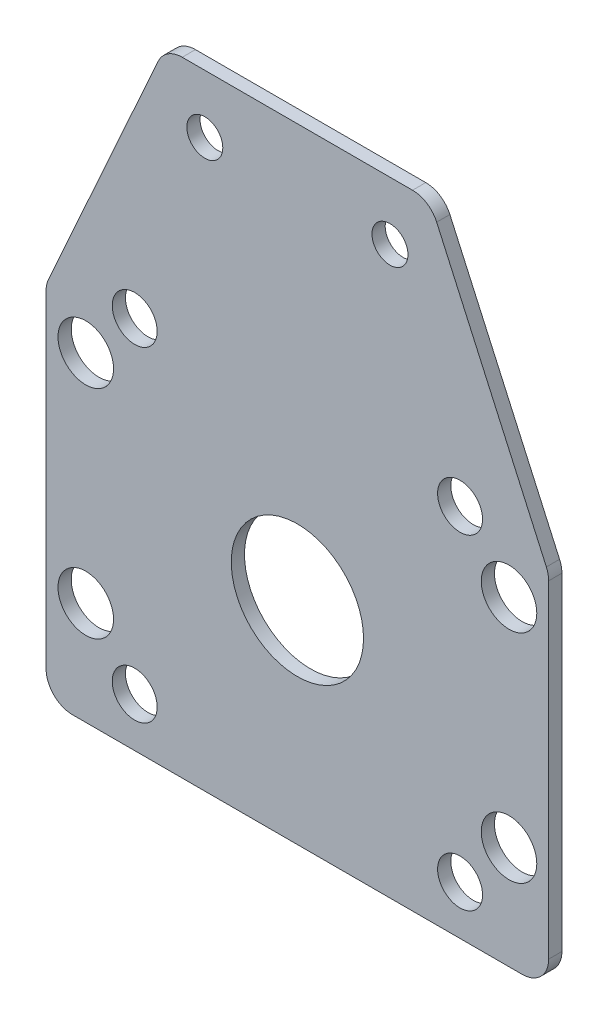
ISO-10303-21;
HEADER;
FILE_DESCRIPTION(('STEP AP214'),'2;1');
FILE_NAME('part.step','',(''),(''),'','','');
FILE_SCHEMA(('AUTOMOTIVE_DESIGN { 1 0 10303 214 1 1 1 1 }'));
ENDSEC;
DATA;
#1=APPLICATION_CONTEXT('core data for automotive mechanical design processes');
#2=APPLICATION_PROTOCOL_DEFINITION('international standard','automotive_design',2000,#1);
#3=PRODUCT_CONTEXT('',#1,'mechanical');
#4=PRODUCT('Part','Part','',(#3));
#5=PRODUCT_RELATED_PRODUCT_CATEGORY('part','',(#4));
#6=PRODUCT_DEFINITION_FORMATION('','',#4);
#7=PRODUCT_DEFINITION_CONTEXT('part definition',#1,'design');
#8=PRODUCT_DEFINITION('design','',#6,#7);
#9=PRODUCT_DEFINITION_SHAPE('','',#8);
#10=(LENGTH_UNIT() NAMED_UNIT(*) SI_UNIT(.MILLI.,.METRE.));
#11=(NAMED_UNIT(*) PLANE_ANGLE_UNIT() SI_UNIT($,.RADIAN.));
#12=(NAMED_UNIT(*) SI_UNIT($,.STERADIAN.) SOLID_ANGLE_UNIT());
#13=UNCERTAINTY_MEASURE_WITH_UNIT(LENGTH_MEASURE(1.E-05),#10,'distance_accuracy_value','');
#14=(GEOMETRIC_REPRESENTATION_CONTEXT(3) GLOBAL_UNCERTAINTY_ASSIGNED_CONTEXT((#13)) GLOBAL_UNIT_ASSIGNED_CONTEXT((#10,
#11,#12)) REPRESENTATION_CONTEXT('',''));
#15=CARTESIAN_POINT('',(0.,0.,0.));
#16=DIRECTION('',(0.,0.,1.));
#17=DIRECTION('',(1.,0.,0.));
#18=AXIS2_PLACEMENT_3D('',#15,#16,#17);
#19=CARTESIAN_POINT('',(-21.7670719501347,113.,2.5));
#20=DIRECTION('',(0.,0.,-0.999999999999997));
#21=DIRECTION('',(-1.,0.,0.));
#22=AXIS2_PLACEMENT_3D('',#19,#20,#21);
#23=CYLINDRICAL_SURFACE('',#22,4.99999999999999);
#24=CARTESIAN_POINT('',(-21.7670719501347,113.,0.));
#25=DIRECTION('',(0.,0.,0.999999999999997));
#26=DIRECTION('',(1.,0.,0.));
#27=AXIS2_PLACEMENT_3D('',#24,#25,#26);
#28=CIRCLE('',#27,4.99999999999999);
#29=CARTESIAN_POINT('',(-21.7670719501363,118.,0.));
#30=VERTEX_POINT('',#29);
#31=CARTESIAN_POINT('',(-26.3266794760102,115.051823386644,-8.32667268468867E-13));
#32=VERTEX_POINT('',#31);
#33=EDGE_CURVE('E131',#30,#32,#28,.T.);
#34=ORIENTED_EDGE('',*,*,#33,.T.);
#35=DIRECTION('',(0.,0.,-0.999999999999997));
#36=VECTOR('',#35,1.);
#37=CARTESIAN_POINT('',(-26.3266794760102,115.051823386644,2.49999999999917));
#38=LINE('',#37,#36);
#39=CARTESIAN_POINT('',(-26.3266794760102,115.051823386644,2.49999999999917));
#40=VERTEX_POINT('',#39);
#41=EDGE_CURVE('E11',#40,#32,#38,.T.);
#42=ORIENTED_EDGE('',*,*,#41,.F.);
#43=CARTESIAN_POINT('',(-21.7670719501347,113.,2.5));
#44=DIRECTION('',(0.,0.,0.999999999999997));
#45=DIRECTION('',(1.,0.,0.));
#46=AXIS2_PLACEMENT_3D('',#43,#44,#45);
#47=CIRCLE('',#46,4.99999999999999);
#48=CARTESIAN_POINT('',(-21.7670719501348,118.,2.5));
#49=VERTEX_POINT('',#48);
#50=EDGE_CURVE('E184',#49,#40,#47,.T.);
#51=ORIENTED_EDGE('',*,*,#50,.F.);
#52=DIRECTION('',(0.,0.,-0.999999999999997));
#53=VECTOR('',#52,1.);
#54=CARTESIAN_POINT('',(-21.7670719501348,118.,2.5));
#55=LINE('',#54,#53);
#56=EDGE_CURVE('E145',#49,#30,#55,.T.);
#57=ORIENTED_EDGE('',*,*,#56,.T.);
#58=EDGE_LOOP('',(#34,#42,#51,#57));
#59=FACE_BOUND('',#58,.T.);
#60=ADVANCED_FACE('F38',(#59),#23,.T.);
#61=CARTESIAN_POINT('',(-26.3266794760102,115.051823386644,2.49999999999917));
#62=DIRECTION('',(0.911921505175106,-0.410364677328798,0.));
#63=DIRECTION('',(0.410364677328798,0.911921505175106,0.));
#64=AXIS2_PLACEMENT_3D('',#61,#62,#63);
#65=PLANE('',#64);
#66=DIRECTION('',(-0.410364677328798,-0.911921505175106,0.));
#67=VECTOR('',#66,1.);
#68=CARTESIAN_POINT('',(-26.3266794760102,115.051823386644,-8.32667268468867E-13));
#69=LINE('',#68,#67);
#70=CARTESIAN_POINT('',(-47.0596075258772,68.9786499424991,-8.32667268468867E-13));
#71=VERTEX_POINT('',#70);
#72=EDGE_CURVE('E127',#32,#71,#69,.T.);
#73=ORIENTED_EDGE('',*,*,#72,.T.);
#74=DIRECTION('',(0.,0.,-0.999999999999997));
#75=VECTOR('',#74,1.);
#76=CARTESIAN_POINT('',(-47.0596075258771,68.9786499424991,2.49999999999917));
#77=LINE('',#76,#75);
#78=CARTESIAN_POINT('',(-47.0596075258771,68.9786499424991,2.49999999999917));
#79=VERTEX_POINT('',#78);
#80=EDGE_CURVE('E46',#79,#71,#77,.T.);
#81=ORIENTED_EDGE('',*,*,#80,.F.);
#82=DIRECTION('',(-0.410364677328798,-0.911921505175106,0.));
#83=VECTOR('',#82,1.);
#84=CARTESIAN_POINT('',(-26.3266794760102,115.051823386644,2.49999999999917));
#85=LINE('',#84,#83);
#86=EDGE_CURVE('E141',#40,#79,#85,.T.);
#87=ORIENTED_EDGE('',*,*,#86,.F.);
#88=ORIENTED_EDGE('',*,*,#41,.T.);
#89=EDGE_LOOP('',(#73,#81,#87,#88));
#90=FACE_BOUND('',#89,.T.);
#91=ADVANCED_FACE('F140',(#90),#65,.F.);
#92=CARTESIAN_POINT('',(-42.5000000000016,66.926826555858,2.49999999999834));
#93=DIRECTION('',(0.,0.,-0.999999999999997));
#94=DIRECTION('',(-1.,0.,0.));
#95=AXIS2_PLACEMENT_3D('',#92,#93,#94);
#96=CYLINDRICAL_SURFACE('',#95,5.);
#97=CARTESIAN_POINT('',(-42.5000000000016,66.926826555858,-1.66533453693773E-12));
#98=DIRECTION('',(0.,0.,0.999999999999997));
#99=DIRECTION('',(1.,0.,0.));
#100=AXIS2_PLACEMENT_3D('',#97,#98,#99);
#101=CIRCLE('',#100,5.);
#102=CARTESIAN_POINT('',(-47.5000000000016,66.9268265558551,0.));
#103=VERTEX_POINT('',#102);
#104=EDGE_CURVE('E133',#71,#103,#101,.T.);
#105=ORIENTED_EDGE('',*,*,#104,.T.);
#106=DIRECTION('',(0.,0.,-0.999999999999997));
#107=VECTOR('',#106,1.);
#108=CARTESIAN_POINT('',(-47.5000000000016,66.9268265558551,2.5));
#109=LINE('',#108,#107);
#110=CARTESIAN_POINT('',(-47.5000000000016,66.9268265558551,2.5));
#111=VERTEX_POINT('',#110);
#112=EDGE_CURVE('E251',#111,#103,#109,.T.);
#113=ORIENTED_EDGE('',*,*,#112,.F.);
#114=CARTESIAN_POINT('',(-42.5000000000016,66.926826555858,2.49999999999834));
#115=DIRECTION('',(0.,0.,0.999999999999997));
#116=DIRECTION('',(1.,0.,0.));
#117=AXIS2_PLACEMENT_3D('',#114,#115,#116);
#118=CIRCLE('',#117,5.);
#119=EDGE_CURVE('E189',#79,#111,#118,.T.);
#120=ORIENTED_EDGE('',*,*,#119,.F.);
#121=ORIENTED_EDGE('',*,*,#80,.T.);
#122=EDGE_LOOP('',(#105,#113,#120,#121));
#123=FACE_BOUND('',#122,.T.);
#124=ADVANCED_FACE('F257',(#123),#96,.T.);
#125=CARTESIAN_POINT('',(-47.5000000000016,66.9268265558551,2.5));
#126=DIRECTION('',(1.,0.,0.));
#127=DIRECTION('',(0.,0.,-0.999999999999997));
#128=AXIS2_PLACEMENT_3D('',#125,#126,#127);
#129=PLANE('',#128);
#130=DIRECTION('',(0.,-1.,0.));
#131=VECTOR('',#130,1.);
#132=CARTESIAN_POINT('',(-47.5000000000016,66.9268265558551,0.));
#133=LINE('',#132,#131);
#134=CARTESIAN_POINT('',(-47.5,5.00000000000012,-8.32667268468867E-13));
#135=VERTEX_POINT('',#134);
#136=EDGE_CURVE('E159',#103,#135,#133,.T.);
#137=ORIENTED_EDGE('',*,*,#136,.T.);
#138=DIRECTION('',(0.,0.,-0.999999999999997));
#139=VECTOR('',#138,1.);
#140=CARTESIAN_POINT('',(-47.5,5.00000000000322,2.49999999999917));
#141=LINE('',#140,#139);
#142=CARTESIAN_POINT('',(-47.5,5.00000000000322,2.49999999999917));
#143=VERTEX_POINT('',#142);
#144=EDGE_CURVE('E247',#143,#135,#141,.T.);
#145=ORIENTED_EDGE('',*,*,#144,.F.);
#146=DIRECTION('',(0.,-1.,0.));
#147=VECTOR('',#146,1.);
#148=CARTESIAN_POINT('',(-47.5000000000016,66.9268265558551,2.5));
#149=LINE('',#148,#147);
#150=EDGE_CURVE('E192',#111,#143,#149,.T.);
#151=ORIENTED_EDGE('',*,*,#150,.F.);
#152=ORIENTED_EDGE('',*,*,#112,.T.);
#153=EDGE_LOOP('',(#137,#145,#151,#152));
#154=FACE_BOUND('',#153,.T.);
#155=ADVANCED_FACE('F265',(#154),#129,.F.);
#156=CARTESIAN_POINT('',(-42.5,5.00000000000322,2.49999999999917));
#157=DIRECTION('',(0.,0.,-0.999999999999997));
#158=DIRECTION('',(-1.,0.,0.));
#159=AXIS2_PLACEMENT_3D('',#156,#157,#158);
#160=CYLINDRICAL_SURFACE('',#159,5.);
#161=CARTESIAN_POINT('',(-42.5,5.00000000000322,-8.32667268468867E-13));
#162=DIRECTION('',(0.,0.,0.999999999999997));
#163=DIRECTION('',(-1.,0.,0.));
#164=AXIS2_PLACEMENT_3D('',#161,#162,#163);
#165=CIRCLE('',#164,5.);
#166=CARTESIAN_POINT('',(-42.5,3.33066907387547E-12,-8.32667268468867E-13));
#167=VERTEX_POINT('',#166);
#168=EDGE_CURVE('E162',#135,#167,#165,.T.);
#169=ORIENTED_EDGE('',*,*,#168,.T.);
#170=DIRECTION('',(0.,0.,-0.999999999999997));
#171=VECTOR('',#170,1.);
#172=CARTESIAN_POINT('',(-42.5,3.33066907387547E-12,2.49999999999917));
#173=LINE('',#172,#171);
#174=CARTESIAN_POINT('',(-42.5,3.33066907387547E-12,2.49999999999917));
#175=VERTEX_POINT('',#174);
#176=EDGE_CURVE('E243',#175,#167,#173,.T.);
#177=ORIENTED_EDGE('',*,*,#176,.F.);
#178=CARTESIAN_POINT('',(-42.5,5.00000000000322,2.49999999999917));
#179=DIRECTION('',(0.,0.,0.999999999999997));
#180=DIRECTION('',(-1.,0.,0.));
#181=AXIS2_PLACEMENT_3D('',#178,#179,#180);
#182=CIRCLE('',#181,5.);
#183=EDGE_CURVE('E195',#143,#175,#182,.T.);
#184=ORIENTED_EDGE('',*,*,#183,.F.);
#185=ORIENTED_EDGE('',*,*,#144,.T.);
#186=EDGE_LOOP('',(#169,#177,#184,#185));
#187=FACE_BOUND('',#186,.T.);
#188=ADVANCED_FACE('F268',(#187),#160,.T.);
#189=CARTESIAN_POINT('',(-42.5,3.33066907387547E-12,2.49999999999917));
#190=DIRECTION('',(0.,1.,0.));
#191=DIRECTION('',(0.,0.,0.999999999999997));
#192=AXIS2_PLACEMENT_3D('',#189,#190,#191);
#193=PLANE('',#192);
#194=DIRECTION('',(1.,0.,0.));
#195=VECTOR('',#194,1.);
#196=CARTESIAN_POINT('',(-42.5,3.33066907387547E-12,-8.32667268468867E-13));
#197=LINE('',#196,#195);
#198=CARTESIAN_POINT('',(42.5,0.,-8.32667268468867E-13));
#199=VERTEX_POINT('',#198);
#200=EDGE_CURVE('E165',#167,#199,#197,.T.);
#201=ORIENTED_EDGE('',*,*,#200,.T.);
#202=DIRECTION('',(0.,0.,-0.999999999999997));
#203=VECTOR('',#202,1.);
#204=CARTESIAN_POINT('',(42.5,0.,2.49999999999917));
#205=LINE('',#204,#203);
#206=CARTESIAN_POINT('',(42.5,0.,2.49999999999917));
#207=VERTEX_POINT('',#206);
#208=EDGE_CURVE('E239',#207,#199,#205,.T.);
#209=ORIENTED_EDGE('',*,*,#208,.F.);
#210=DIRECTION('',(1.,0.,0.));
#211=VECTOR('',#210,1.);
#212=CARTESIAN_POINT('',(-42.5,3.33066907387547E-12,2.49999999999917));
#213=LINE('',#212,#211);
#214=EDGE_CURVE('E198',#175,#207,#213,.T.);
#215=ORIENTED_EDGE('',*,*,#214,.F.);
#216=ORIENTED_EDGE('',*,*,#176,.T.);
#217=EDGE_LOOP('',(#201,#209,#215,#216));
#218=FACE_BOUND('',#217,.T.);
#219=ADVANCED_FACE('F273',(#218),#193,.F.);
#220=CARTESIAN_POINT('',(42.5,5.00000000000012,2.49999999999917));
#221=DIRECTION('',(0.,0.,-0.999999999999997));
#222=DIRECTION('',(-1.,0.,0.));
#223=AXIS2_PLACEMENT_3D('',#220,#221,#222);
#224=CYLINDRICAL_SURFACE('',#223,5.);
#225=CARTESIAN_POINT('',(42.5,5.00000000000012,-8.32667268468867E-13));
#226=DIRECTION('',(0.,0.,0.999999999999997));
#227=DIRECTION('',(1.,0.,0.));
#228=AXIS2_PLACEMENT_3D('',#225,#226,#227);
#229=CIRCLE('',#228,5.);
#230=CARTESIAN_POINT('',(47.5,5.00000000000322,0.));
#231=VERTEX_POINT('',#230);
#232=EDGE_CURVE('E168',#199,#231,#229,.T.);
#233=ORIENTED_EDGE('',*,*,#232,.T.);
#234=DIRECTION('',(0.,0.,-0.999999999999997));
#235=VECTOR('',#234,1.);
#236=CARTESIAN_POINT('',(47.5,5.00000000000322,2.5));
#237=LINE('',#236,#235);
#238=CARTESIAN_POINT('',(47.5,5.00000000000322,2.5));
#239=VERTEX_POINT('',#238);
#240=EDGE_CURVE('E235',#239,#231,#237,.T.);
#241=ORIENTED_EDGE('',*,*,#240,.F.);
#242=CARTESIAN_POINT('',(42.5,5.00000000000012,2.49999999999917));
#243=DIRECTION('',(0.,0.,0.999999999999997));
#244=DIRECTION('',(1.,0.,0.));
#245=AXIS2_PLACEMENT_3D('',#242,#243,#244);
#246=CIRCLE('',#245,5.);
#247=EDGE_CURVE('E201',#207,#239,#246,.T.);
#248=ORIENTED_EDGE('',*,*,#247,.F.);
#249=ORIENTED_EDGE('',*,*,#208,.T.);
#250=EDGE_LOOP('',(#233,#241,#248,#249));
#251=FACE_BOUND('',#250,.T.);
#252=ADVANCED_FACE('F279',(#251),#224,.T.);
#253=CARTESIAN_POINT('',(47.5,5.00000000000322,2.5));
#254=DIRECTION('',(-1.,0.,0.));
#255=DIRECTION('',(0.,-1.,0.));
#256=AXIS2_PLACEMENT_3D('',#253,#254,#255);
#257=PLANE('',#256);
#258=DIRECTION('',(0.,1.,0.));
#259=VECTOR('',#258,1.);
#260=CARTESIAN_POINT('',(47.5,5.00000000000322,0.));
#261=LINE('',#260,#259);
#262=CARTESIAN_POINT('',(47.5,66.9268265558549,0.));
#263=VERTEX_POINT('',#262);
#264=EDGE_CURVE('E171',#231,#263,#261,.T.);
#265=ORIENTED_EDGE('',*,*,#264,.T.);
#266=DIRECTION('',(0.,0.,-0.999999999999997));
#267=VECTOR('',#266,1.);
#268=CARTESIAN_POINT('',(47.4999999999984,66.9268265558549,2.5));
#269=LINE('',#268,#267);
#270=CARTESIAN_POINT('',(47.4999999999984,66.9268265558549,2.5));
#271=VERTEX_POINT('',#270);
#272=EDGE_CURVE('E231',#271,#263,#269,.T.);
#273=ORIENTED_EDGE('',*,*,#272,.F.);
#274=DIRECTION('',(0.,1.,0.));
#275=VECTOR('',#274,1.);
#276=CARTESIAN_POINT('',(47.5,5.00000000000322,2.5));
#277=LINE('',#276,#275);
#278=EDGE_CURVE('E204',#239,#271,#277,.T.);
#279=ORIENTED_EDGE('',*,*,#278,.F.);
#280=ORIENTED_EDGE('',*,*,#240,.T.);
#281=EDGE_LOOP('',(#265,#273,#279,#280));
#282=FACE_BOUND('',#281,.T.);
#283=ADVANCED_FACE('F283',(#282),#257,.F.);
#284=CARTESIAN_POINT('',(42.4999999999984,66.9268265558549,2.5));
#285=DIRECTION('',(0.,0.,-0.999999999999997));
#286=DIRECTION('',(-1.,0.,0.));
#287=AXIS2_PLACEMENT_3D('',#284,#285,#286);
#288=CYLINDRICAL_SURFACE('',#287,4.99999999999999);
#289=CARTESIAN_POINT('',(42.5,66.9268265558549,0.));
#290=DIRECTION('',(0.,0.,0.999999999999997));
#291=DIRECTION('',(1.,0.,0.));
#292=AXIS2_PLACEMENT_3D('',#289,#290,#291);
#293=CIRCLE('',#292,4.99999999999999);
#294=CARTESIAN_POINT('',(47.0596075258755,68.9786499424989,0.));
#295=VERTEX_POINT('',#294);
#296=EDGE_CURVE('E173',#263,#295,#293,.T.);
#297=ORIENTED_EDGE('',*,*,#296,.T.);
#298=DIRECTION('',(0.,0.,-0.999999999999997));
#299=VECTOR('',#298,1.);
#300=CARTESIAN_POINT('',(47.0596075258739,68.9786499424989,2.5));
#301=LINE('',#300,#299);
#302=CARTESIAN_POINT('',(47.0596075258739,68.9786499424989,2.5));
#303=VERTEX_POINT('',#302);
#304=EDGE_CURVE('E227',#303,#295,#301,.T.);
#305=ORIENTED_EDGE('',*,*,#304,.F.);
#306=CARTESIAN_POINT('',(42.4999999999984,66.9268265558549,2.5));
#307=DIRECTION('',(0.,0.,0.999999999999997));
#308=DIRECTION('',(1.,0.,0.));
#309=AXIS2_PLACEMENT_3D('',#306,#307,#308);
#310=CIRCLE('',#309,4.99999999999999);
#311=EDGE_CURVE('E207',#271,#303,#310,.T.);
#312=ORIENTED_EDGE('',*,*,#311,.F.);
#313=ORIENTED_EDGE('',*,*,#272,.T.);
#314=EDGE_LOOP('',(#297,#305,#312,#313));
#315=FACE_BOUND('',#314,.T.);
#316=ADVANCED_FACE('F288',(#315),#288,.T.);
#317=CARTESIAN_POINT('',(47.0596075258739,68.9786499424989,2.5));
#318=DIRECTION('',(-0.911921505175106,-0.410364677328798,0.));
#319=DIRECTION('',(0.410364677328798,-0.911921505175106,0.));
#320=AXIS2_PLACEMENT_3D('',#317,#318,#319);
#321=PLANE('',#320);
#322=DIRECTION('',(-0.410364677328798,0.911921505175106,0.));
#323=VECTOR('',#322,1.);
#324=CARTESIAN_POINT('',(47.0596075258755,68.9786499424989,0.));
#325=LINE('',#324,#323);
#326=CARTESIAN_POINT('',(26.3266794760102,115.051823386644,-8.32667268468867E-13));
#327=VERTEX_POINT('',#326);
#328=EDGE_CURVE('E176',#295,#327,#325,.T.);
#329=ORIENTED_EDGE('',*,*,#328,.T.);
#330=DIRECTION('',(0.,0.,-0.999999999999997));
#331=VECTOR('',#330,1.);
#332=CARTESIAN_POINT('',(26.3266794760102,115.051823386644,2.49999999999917));
#333=LINE('',#332,#331);
#334=CARTESIAN_POINT('',(26.3266794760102,115.051823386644,2.49999999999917));
#335=VERTEX_POINT('',#334);
#336=EDGE_CURVE('E223',#335,#327,#333,.T.);
#337=ORIENTED_EDGE('',*,*,#336,.F.);
#338=DIRECTION('',(-0.410364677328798,0.911921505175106,0.));
#339=VECTOR('',#338,1.);
#340=CARTESIAN_POINT('',(47.0596075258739,68.9786499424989,2.5));
#341=LINE('',#340,#339);
#342=EDGE_CURVE('E210',#303,#335,#341,.T.);
#343=ORIENTED_EDGE('',*,*,#342,.F.);
#344=ORIENTED_EDGE('',*,*,#304,.T.);
#345=EDGE_LOOP('',(#329,#337,#343,#344));
#346=FACE_BOUND('',#345,.T.);
#347=ADVANCED_FACE('F292',(#346),#321,.F.);
#348=CARTESIAN_POINT('',(21.7670719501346,113.,2.5));
#349=DIRECTION('',(0.,0.,-0.999999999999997));
#350=DIRECTION('',(-1.,0.,0.));
#351=AXIS2_PLACEMENT_3D('',#348,#349,#350);
#352=CYLINDRICAL_SURFACE('',#351,4.99999999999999);
#353=CARTESIAN_POINT('',(21.7670719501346,113.,0.));
#354=DIRECTION('',(0.,0.,0.999999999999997));
#355=DIRECTION('',(1.,0.,0.));
#356=AXIS2_PLACEMENT_3D('',#353,#354,#355);
#357=CIRCLE('',#356,4.99999999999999);
#358=CARTESIAN_POINT('',(21.7670719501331,118.,0.));
#359=VERTEX_POINT('',#358);
#360=EDGE_CURVE('E179',#327,#359,#357,.T.);
#361=ORIENTED_EDGE('',*,*,#360,.T.);
#362=DIRECTION('',(0.,0.,-0.999999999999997));
#363=VECTOR('',#362,1.);
#364=CARTESIAN_POINT('',(21.7670719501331,118.,2.5));
#365=LINE('',#364,#363);
#366=CARTESIAN_POINT('',(21.7670719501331,118.,2.5));
#367=VERTEX_POINT('',#366);
#368=EDGE_CURVE('E219',#367,#359,#365,.T.);
#369=ORIENTED_EDGE('',*,*,#368,.F.);
#370=CARTESIAN_POINT('',(21.7670719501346,113.,2.5));
#371=DIRECTION('',(0.,0.,0.999999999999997));
#372=DIRECTION('',(1.,0.,0.));
#373=AXIS2_PLACEMENT_3D('',#370,#371,#372);
#374=CIRCLE('',#373,4.99999999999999);
#375=EDGE_CURVE('E58',#335,#367,#374,.T.);
#376=ORIENTED_EDGE('',*,*,#375,.F.);
#377=ORIENTED_EDGE('',*,*,#336,.T.);
#378=EDGE_LOOP('',(#361,#369,#376,#377));
#379=FACE_BOUND('',#378,.T.);
#380=ADVANCED_FACE('F296',(#379),#352,.T.);
#381=CARTESIAN_POINT('',(21.7670719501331,118.,2.5));
#382=DIRECTION('',(0.,-1.,0.));
#383=DIRECTION('',(0.,0.,-0.999999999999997));
#384=AXIS2_PLACEMENT_3D('',#381,#382,#383);
#385=PLANE('',#384);
#386=DIRECTION('',(-1.,0.,0.));
#387=VECTOR('',#386,1.);
#388=CARTESIAN_POINT('',(21.7670719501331,118.,0.));
#389=LINE('',#388,#387);
#390=EDGE_CURVE('E181',#359,#30,#389,.T.);
#391=ORIENTED_EDGE('',*,*,#390,.T.);
#392=ORIENTED_EDGE('',*,*,#56,.F.);
#393=DIRECTION('',(-1.,0.,0.));
#394=VECTOR('',#393,1.);
#395=CARTESIAN_POINT('',(21.7670719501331,118.,2.5));
#396=LINE('',#395,#394);
#397=EDGE_CURVE('E53',#367,#49,#396,.T.);
#398=ORIENTED_EDGE('',*,*,#397,.F.);
#399=ORIENTED_EDGE('',*,*,#368,.T.);
#400=EDGE_LOOP('',(#391,#392,#398,#399));
#401=FACE_BOUND('',#400,.T.);
#402=ADVANCED_FACE('F298',(#401),#385,.F.);
#403=CARTESIAN_POINT('',(-21.7670719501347,113.,2.5));
#404=DIRECTION('',(0.,0.,0.999999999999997));
#405=DIRECTION('',(1.,0.,0.));
#406=AXIS2_PLACEMENT_3D('',#403,#404,#405);
#407=PLANE('',#406);
#408=CARTESIAN_POINT('',(17.4999999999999,107.,2.49999999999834));
#409=DIRECTION('',(0.,0.,0.999999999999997));
#410=DIRECTION('',(1.,0.,0.));
#411=AXIS2_PLACEMENT_3D('',#408,#409,#410);
#412=CIRCLE('',#411,3.4);
#413=CARTESIAN_POINT('',(20.8999999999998,107.,2.49999999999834));
#414=VERTEX_POINT('',#413);
#415=EDGE_CURVE('E580',#414,#414,#412,.T.);
#416=ORIENTED_EDGE('',*,*,#415,.F.);
#417=EDGE_LOOP('',(#416));
#418=FACE_BOUND('',#417,.T.);
#419=CARTESIAN_POINT('',(-17.5000000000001,107.,2.49999999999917));
#420=DIRECTION('',(0.,0.,0.999999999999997));
#421=DIRECTION('',(1.,0.,0.));
#422=AXIS2_PLACEMENT_3D('',#419,#420,#421);
#423=CIRCLE('',#422,3.4);
#424=CARTESIAN_POINT('',(-14.1000000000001,107.,2.49999999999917));
#425=VERTEX_POINT('',#424);
#426=EDGE_CURVE('E584',#425,#425,#423,.T.);
#427=ORIENTED_EDGE('',*,*,#426,.F.);
#428=EDGE_LOOP('',(#427));
#429=FACE_BOUND('',#428,.T.);
#430=CARTESIAN_POINT('',(-30.7500000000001,70.7499999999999,2.49999999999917));
#431=DIRECTION('',(0.,0.,0.999999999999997));
#432=DIRECTION('',(1.,0.,0.));
#433=AXIS2_PLACEMENT_3D('',#430,#431,#432);
#434=CIRCLE('',#433,4.25);
#435=CARTESIAN_POINT('',(-26.5000000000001,70.7499999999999,2.49999999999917));
#436=VERTEX_POINT('',#435);
#437=EDGE_CURVE('E594',#436,#436,#434,.T.);
#438=ORIENTED_EDGE('',*,*,#437,.F.);
#439=EDGE_LOOP('',(#438));
#440=FACE_BOUND('',#439,.T.);
#441=CARTESIAN_POINT('',(30.7499999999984,70.7500000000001,2.5));
#442=DIRECTION('',(0.,0.,0.999999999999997));
#443=DIRECTION('',(1.,0.,0.));
#444=AXIS2_PLACEMENT_3D('',#441,#442,#443);
#445=CIRCLE('',#444,4.25);
#446=CARTESIAN_POINT('',(34.9999999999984,70.7500000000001,2.5));
#447=VERTEX_POINT('',#446);
#448=EDGE_CURVE('E602',#447,#447,#445,.T.);
#449=ORIENTED_EDGE('',*,*,#448,.F.);
#450=EDGE_LOOP('',(#449));
#451=FACE_BOUND('',#450,.T.);
#452=CARTESIAN_POINT('',(30.7499999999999,9.24999999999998,2.49999999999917));
#453=DIRECTION('',(0.,0.,0.999999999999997));
#454=DIRECTION('',(1.,0.,0.));
#455=AXIS2_PLACEMENT_3D('',#452,#453,#454);
#456=CIRCLE('',#455,4.25);
#457=CARTESIAN_POINT('',(35.,9.24999999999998,2.49999999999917));
#458=VERTEX_POINT('',#457);
#459=EDGE_CURVE('E610',#458,#458,#456,.T.);
#460=ORIENTED_EDGE('',*,*,#459,.F.);
#461=EDGE_LOOP('',(#460));
#462=FACE_BOUND('',#461,.T.);
#463=CARTESIAN_POINT('',(-30.7500000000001,9.24999999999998,2.5));
#464=DIRECTION('',(0.,0.,0.999999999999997));
#465=DIRECTION('',(1.,0.,0.));
#466=AXIS2_PLACEMENT_3D('',#463,#464,#465);
#467=CIRCLE('',#466,4.25);
#468=CARTESIAN_POINT('',(-26.5000000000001,9.24999999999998,2.5));
#469=VERTEX_POINT('',#468);
#470=EDGE_CURVE('E618',#469,#469,#467,.T.);
#471=ORIENTED_EDGE('',*,*,#470,.F.);
#472=EDGE_LOOP('',(#471));
#473=FACE_BOUND('',#472,.T.);
#474=CARTESIAN_POINT('',(-40.,19.4999999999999,2.49999999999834));
#475=DIRECTION('',(0.,0.,0.999999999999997));
#476=DIRECTION('',(1.,0.,0.));
#477=AXIS2_PLACEMENT_3D('',#474,#475,#476);
#478=CIRCLE('',#477,5.25);
#479=CARTESIAN_POINT('',(-34.75,19.4999999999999,2.49999999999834));
#480=VERTEX_POINT('',#479);
#481=EDGE_CURVE('E630',#480,#480,#478,.T.);
#482=ORIENTED_EDGE('',*,*,#481,.F.);
#483=EDGE_LOOP('',(#482));
#484=FACE_BOUND('',#483,.T.);
#485=CARTESIAN_POINT('',(39.9999999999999,19.5000000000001,2.49999999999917));
#486=DIRECTION('',(0.,0.,0.999999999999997));
#487=DIRECTION('',(1.,0.,0.));
#488=AXIS2_PLACEMENT_3D('',#485,#486,#487);
#489=CIRCLE('',#488,5.25);
#490=CARTESIAN_POINT('',(45.2499999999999,19.5000000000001,2.49999999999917));
#491=VERTEX_POINT('',#490);
#492=EDGE_CURVE('E638',#491,#491,#489,.T.);
#493=ORIENTED_EDGE('',*,*,#492,.F.);
#494=EDGE_LOOP('',(#493));
#495=FACE_BOUND('',#494,.T.);
#496=CARTESIAN_POINT('',(39.9999999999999,60.5,2.49999999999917));
#497=DIRECTION('',(0.,0.,0.999999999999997));
#498=DIRECTION('',(1.,0.,0.));
#499=AXIS2_PLACEMENT_3D('',#496,#497,#498);
#500=CIRCLE('',#499,5.25);
#501=CARTESIAN_POINT('',(45.2499999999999,60.5,2.49999999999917));
#502=VERTEX_POINT('',#501);
#503=EDGE_CURVE('E646',#502,#502,#500,.T.);
#504=ORIENTED_EDGE('',*,*,#503,.F.);
#505=EDGE_LOOP('',(#504));
#506=FACE_BOUND('',#505,.T.);
#507=CARTESIAN_POINT('',(-40.0000000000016,60.5,2.49999999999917));
#508=DIRECTION('',(0.,0.,0.999999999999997));
#509=DIRECTION('',(1.,0.,0.));
#510=AXIS2_PLACEMENT_3D('',#507,#508,#509);
#511=CIRCLE('',#510,5.25);
#512=CARTESIAN_POINT('',(-34.7500000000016,60.5,2.49999999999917));
#513=VERTEX_POINT('',#512);
#514=EDGE_CURVE('E654',#513,#513,#511,.T.);
#515=ORIENTED_EDGE('',*,*,#514,.F.);
#516=EDGE_LOOP('',(#515));
#517=FACE_BOUND('',#516,.T.);
#518=CARTESIAN_POINT('',(0.,40.,2.5));
#519=DIRECTION('',(0.,0.,0.999999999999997));
#520=DIRECTION('',(1.,0.,0.));
#521=AXIS2_PLACEMENT_3D('',#518,#519,#520);
#522=CIRCLE('',#521,12.5);
#523=CARTESIAN_POINT('',(12.5,40.,2.5));
#524=VERTEX_POINT('',#523);
#525=EDGE_CURVE('E153',#524,#524,#522,.T.);
#526=ORIENTED_EDGE('',*,*,#525,.F.);
#527=EDGE_LOOP('',(#526));
#528=FACE_BOUND('',#527,.T.);
#529=ORIENTED_EDGE('',*,*,#50,.T.);
#530=ORIENTED_EDGE('',*,*,#86,.T.);
#531=ORIENTED_EDGE('',*,*,#119,.T.);
#532=ORIENTED_EDGE('',*,*,#150,.T.);
#533=ORIENTED_EDGE('',*,*,#183,.T.);
#534=ORIENTED_EDGE('',*,*,#214,.T.);
#535=ORIENTED_EDGE('',*,*,#247,.T.);
#536=ORIENTED_EDGE('',*,*,#278,.T.);
#537=ORIENTED_EDGE('',*,*,#311,.T.);
#538=ORIENTED_EDGE('',*,*,#342,.T.);
#539=ORIENTED_EDGE('',*,*,#375,.T.);
#540=ORIENTED_EDGE('',*,*,#397,.T.);
#541=EDGE_LOOP('',(#529,#530,#531,#532,#533,#534,#535,#536,#537,#538,#539,#540));
#542=FACE_BOUND('',#541,.T.);
#543=ADVANCED_FACE('F260',(#418,#429,#440,#451,#462,#473,#484,#495,#506,#517,#528,#542),#407,.T.);
#544=CARTESIAN_POINT('',(-21.7670719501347,113.,0.));
#545=DIRECTION('',(0.,0.,0.999999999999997));
#546=DIRECTION('',(1.,0.,0.));
#547=AXIS2_PLACEMENT_3D('',#544,#545,#546);
#548=PLANE('',#547);
#549=CARTESIAN_POINT('',(17.4999999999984,107.,-1.66533453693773E-12));
#550=DIRECTION('',(0.,0.,0.999999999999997));
#551=DIRECTION('',(1.,0.,0.));
#552=AXIS2_PLACEMENT_3D('',#549,#550,#551);
#553=CIRCLE('',#552,3.4);
#554=CARTESIAN_POINT('',(20.8999999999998,107.,-1.66533453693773E-12));
#555=VERTEX_POINT('',#554);
#556=EDGE_CURVE('E577',#555,#555,#553,.T.);
#557=ORIENTED_EDGE('',*,*,#556,.T.);
#558=EDGE_LOOP('',(#557));
#559=FACE_BOUND('',#558,.T.);
#560=CARTESIAN_POINT('',(-17.5000000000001,107.,-8.32667268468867E-13));
#561=DIRECTION('',(0.,0.,0.999999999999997));
#562=DIRECTION('',(1.,0.,0.));
#563=AXIS2_PLACEMENT_3D('',#560,#561,#562);
#564=CIRCLE('',#563,3.4);
#565=CARTESIAN_POINT('',(-14.1000000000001,107.,-8.32667268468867E-13));
#566=VERTEX_POINT('',#565);
#567=EDGE_CURVE('E590',#566,#566,#564,.T.);
#568=ORIENTED_EDGE('',*,*,#567,.T.);
#569=EDGE_LOOP('',(#568));
#570=FACE_BOUND('',#569,.T.);
#571=CARTESIAN_POINT('',(-30.7500000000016,70.7499999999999,-8.32667268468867E-13));
#572=DIRECTION('',(0.,0.,0.999999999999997));
#573=DIRECTION('',(1.,0.,0.));
#574=AXIS2_PLACEMENT_3D('',#571,#572,#573);
#575=CIRCLE('',#574,4.25);
#576=CARTESIAN_POINT('',(-26.5000000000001,70.7499999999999,-8.31799906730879E-13));
#577=VERTEX_POINT('',#576);
#578=EDGE_CURVE('E598',#577,#577,#575,.T.);
#579=ORIENTED_EDGE('',*,*,#578,.T.);
#580=EDGE_LOOP('',(#579));
#581=FACE_BOUND('',#580,.T.);
#582=CARTESIAN_POINT('',(30.7499999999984,70.7500000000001,0.));
#583=DIRECTION('',(0.,0.,0.999999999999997));
#584=DIRECTION('',(1.,0.,0.));
#585=AXIS2_PLACEMENT_3D('',#582,#583,#584);
#586=CIRCLE('',#585,4.25);
#587=CARTESIAN_POINT('',(34.9999999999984,70.7500000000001,0.));
#588=VERTEX_POINT('',#587);
#589=EDGE_CURVE('E606',#588,#588,#586,.T.);
#590=ORIENTED_EDGE('',*,*,#589,.T.);
#591=EDGE_LOOP('',(#590));
#592=FACE_BOUND('',#591,.T.);
#593=CARTESIAN_POINT('',(30.7499999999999,9.24999999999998,-8.32667268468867E-13));
#594=DIRECTION('',(0.,0.,0.999999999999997));
#595=DIRECTION('',(1.,0.,0.));
#596=AXIS2_PLACEMENT_3D('',#593,#594,#595);
#597=CIRCLE('',#596,4.25);
#598=CARTESIAN_POINT('',(35.,9.24999999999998,-8.31799906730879E-13));
#599=VERTEX_POINT('',#598);
#600=EDGE_CURVE('E614',#599,#599,#597,.T.);
#601=ORIENTED_EDGE('',*,*,#600,.T.);
#602=EDGE_LOOP('',(#601));
#603=FACE_BOUND('',#602,.T.);
#604=CARTESIAN_POINT('',(-30.7500000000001,9.24999999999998,0.));
#605=DIRECTION('',(0.,0.,0.999999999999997));
#606=DIRECTION('',(1.,0.,0.));
#607=AXIS2_PLACEMENT_3D('',#604,#605,#606);
#608=CIRCLE('',#607,4.25);
#609=CARTESIAN_POINT('',(-26.5000000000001,9.24999999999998,0.));
#610=VERTEX_POINT('',#609);
#611=EDGE_CURVE('E622',#610,#610,#608,.T.);
#612=ORIENTED_EDGE('',*,*,#611,.T.);
#613=EDGE_LOOP('',(#612));
#614=FACE_BOUND('',#613,.T.);
#615=CARTESIAN_POINT('',(-40.,19.4999999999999,-1.66533453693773E-12));
#616=DIRECTION('',(0.,0.,0.999999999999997));
#617=DIRECTION('',(1.,0.,0.));
#618=AXIS2_PLACEMENT_3D('',#615,#616,#617);
#619=CIRCLE('',#618,5.25);
#620=CARTESIAN_POINT('',(-34.75,19.4999999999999,-1.66446717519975E-12));
#621=VERTEX_POINT('',#620);
#622=EDGE_CURVE('E626',#621,#621,#619,.T.);
#623=ORIENTED_EDGE('',*,*,#622,.T.);
#624=EDGE_LOOP('',(#623));
#625=FACE_BOUND('',#624,.T.);
#626=CARTESIAN_POINT('',(39.9999999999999,19.5000000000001,-8.32667268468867E-13));
#627=DIRECTION('',(0.,0.,0.999999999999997));
#628=DIRECTION('',(1.,0.,0.));
#629=AXIS2_PLACEMENT_3D('',#626,#627,#628);
#630=CIRCLE('',#629,5.25);
#631=CARTESIAN_POINT('',(45.2499999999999,19.5000000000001,-8.31799906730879E-13));
#632=VERTEX_POINT('',#631);
#633=EDGE_CURVE('E634',#632,#632,#630,.T.);
#634=ORIENTED_EDGE('',*,*,#633,.T.);
#635=EDGE_LOOP('',(#634));
#636=FACE_BOUND('',#635,.T.);
#637=CARTESIAN_POINT('',(39.9999999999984,60.5,-8.32667268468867E-13));
#638=DIRECTION('',(0.,0.,0.999999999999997));
#639=DIRECTION('',(1.,0.,0.));
#640=AXIS2_PLACEMENT_3D('',#637,#638,#639);
#641=CIRCLE('',#640,5.25);
#642=CARTESIAN_POINT('',(45.2499999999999,60.5,-8.31799906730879E-13));
#643=VERTEX_POINT('',#642);
#644=EDGE_CURVE('E642',#643,#643,#641,.T.);
#645=ORIENTED_EDGE('',*,*,#644,.T.);
#646=EDGE_LOOP('',(#645));
#647=FACE_BOUND('',#646,.T.);
#648=CARTESIAN_POINT('',(-40.,60.5,-8.32667268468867E-13));
#649=DIRECTION('',(0.,0.,0.999999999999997));
#650=DIRECTION('',(1.,0.,0.));
#651=AXIS2_PLACEMENT_3D('',#648,#649,#650);
#652=CIRCLE('',#651,5.25);
#653=CARTESIAN_POINT('',(-34.7500000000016,60.5,-8.31799906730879E-13));
#654=VERTEX_POINT('',#653);
#655=EDGE_CURVE('E650',#654,#654,#652,.T.);
#656=ORIENTED_EDGE('',*,*,#655,.T.);
#657=EDGE_LOOP('',(#656));
#658=FACE_BOUND('',#657,.T.);
#659=CARTESIAN_POINT('',(0.,40.,0.));
#660=DIRECTION('',(0.,0.,0.999999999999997));
#661=DIRECTION('',(1.,0.,0.));
#662=AXIS2_PLACEMENT_3D('',#659,#660,#661);
#663=CIRCLE('',#662,12.5);
#664=CARTESIAN_POINT('',(12.5,40.,0.));
#665=VERTEX_POINT('',#664);
#666=EDGE_CURVE('E147',#665,#665,#663,.T.);
#667=ORIENTED_EDGE('',*,*,#666,.T.);
#668=EDGE_LOOP('',(#667));
#669=FACE_BOUND('',#668,.T.);
#670=ORIENTED_EDGE('',*,*,#33,.F.);
#671=ORIENTED_EDGE('',*,*,#390,.F.);
#672=ORIENTED_EDGE('',*,*,#360,.F.);
#673=ORIENTED_EDGE('',*,*,#328,.F.);
#674=ORIENTED_EDGE('',*,*,#296,.F.);
#675=ORIENTED_EDGE('',*,*,#264,.F.);
#676=ORIENTED_EDGE('',*,*,#232,.F.);
#677=ORIENTED_EDGE('',*,*,#200,.F.);
#678=ORIENTED_EDGE('',*,*,#168,.F.);
#679=ORIENTED_EDGE('',*,*,#136,.F.);
#680=ORIENTED_EDGE('',*,*,#104,.F.);
#681=ORIENTED_EDGE('',*,*,#72,.F.);
#682=EDGE_LOOP('',(#670,#671,#672,#673,#674,#675,#676,#677,#678,#679,#680,#681));
#683=FACE_BOUND('',#682,.T.);
#684=ADVANCED_FACE('F128',(#559,#570,#581,#592,#603,#614,#625,#636,#647,#658,#669,#683),#548,.F.);
#685=CARTESIAN_POINT('',(0.,40.,2.5));
#686=DIRECTION('',(0.,0.,0.999999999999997));
#687=DIRECTION('',(1.,0.,0.));
#688=AXIS2_PLACEMENT_3D('',#685,#686,#687);
#689=CYLINDRICAL_SURFACE('',#688,12.5);
#690=CARTESIAN_POINT('',(12.5,40.,0.));
#691=CARTESIAN_POINT('',(12.5,40.,0.0260416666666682));
#692=CARTESIAN_POINT('',(12.5,40.,0.052083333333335));
#693=CARTESIAN_POINT('',(12.5,40.,0.104166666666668));
#694=CARTESIAN_POINT('',(12.5,40.,0.130208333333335));
#695=CARTESIAN_POINT('',(12.5,40.,0.182291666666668));
#696=CARTESIAN_POINT('',(12.5,40.,0.208333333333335));
#697=CARTESIAN_POINT('',(12.5,40.,0.260416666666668));
#698=CARTESIAN_POINT('',(12.5,40.,0.286458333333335));
#699=CARTESIAN_POINT('',(12.5,40.,0.338541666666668));
#700=CARTESIAN_POINT('',(12.5,40.,0.364583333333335));
#701=CARTESIAN_POINT('',(12.5,40.,0.416666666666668));
#702=CARTESIAN_POINT('',(12.5,40.,0.442708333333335));
#703=CARTESIAN_POINT('',(12.5,40.,0.494791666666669));
#704=CARTESIAN_POINT('',(12.5,40.,0.520833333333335));
#705=CARTESIAN_POINT('',(12.5,40.,0.572916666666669));
#706=CARTESIAN_POINT('',(12.5,40.,0.598958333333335));
#707=CARTESIAN_POINT('',(12.5,40.,0.651041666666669));
#708=CARTESIAN_POINT('',(12.5,40.,0.677083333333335));
#709=CARTESIAN_POINT('',(12.5,40.,0.729166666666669));
#710=CARTESIAN_POINT('',(12.5,40.,0.755208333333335));
#711=CARTESIAN_POINT('',(12.5,40.,0.807291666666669));
#712=CARTESIAN_POINT('',(12.5,40.,0.833333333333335));
#713=CARTESIAN_POINT('',(12.5,40.,0.885416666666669));
#714=CARTESIAN_POINT('',(12.5,40.,0.911458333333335));
#715=CARTESIAN_POINT('',(12.5,40.,0.963541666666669));
#716=CARTESIAN_POINT('',(12.5,40.,0.989583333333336));
#717=CARTESIAN_POINT('',(12.5,40.,1.04166666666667));
#718=CARTESIAN_POINT('',(12.5,40.,1.06770833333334));
#719=CARTESIAN_POINT('',(12.5,40.,1.11979166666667));
#720=CARTESIAN_POINT('',(12.5,40.,1.14583333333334));
#721=CARTESIAN_POINT('',(12.5,40.,1.19791666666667));
#722=CARTESIAN_POINT('',(12.5,40.,1.22395833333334));
#723=CARTESIAN_POINT('',(12.5,40.,1.27604166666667));
#724=CARTESIAN_POINT('',(12.5,40.,1.30208333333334));
#725=CARTESIAN_POINT('',(12.5,40.,1.35416666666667));
#726=CARTESIAN_POINT('',(12.5,40.,1.38020833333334));
#727=CARTESIAN_POINT('',(12.5,40.,1.43229166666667));
#728=CARTESIAN_POINT('',(12.5,40.,1.45833333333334));
#729=CARTESIAN_POINT('',(12.5,40.,1.51041666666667));
#730=CARTESIAN_POINT('',(12.5,40.,1.53645833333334));
#731=CARTESIAN_POINT('',(12.5,40.,1.58854166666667));
#732=CARTESIAN_POINT('',(12.5,40.,1.61458333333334));
#733=CARTESIAN_POINT('',(12.5,40.,1.66666666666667));
#734=CARTESIAN_POINT('',(12.5,40.,1.69270833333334));
#735=CARTESIAN_POINT('',(12.5,40.,1.74479166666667));
#736=CARTESIAN_POINT('',(12.5,40.,1.77083333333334));
#737=CARTESIAN_POINT('',(12.5,40.,1.82291666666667));
#738=CARTESIAN_POINT('',(12.5,40.,1.84895833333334));
#739=CARTESIAN_POINT('',(12.5,40.,1.90104166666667));
#740=CARTESIAN_POINT('',(12.5,40.,1.92708333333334));
#741=CARTESIAN_POINT('',(12.5,40.,1.97916666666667));
#742=CARTESIAN_POINT('',(12.5,40.,2.00520833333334));
#743=CARTESIAN_POINT('',(12.5,40.,2.05729166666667));
#744=CARTESIAN_POINT('',(12.5,40.,2.08333333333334));
#745=CARTESIAN_POINT('',(12.5,40.,2.13541666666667));
#746=CARTESIAN_POINT('',(12.5,40.,2.16145833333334));
#747=CARTESIAN_POINT('',(12.5,40.,2.21354166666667));
#748=CARTESIAN_POINT('',(12.5,40.,2.23958333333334));
#749=CARTESIAN_POINT('',(12.5,40.,2.29166666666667));
#750=CARTESIAN_POINT('',(12.5,40.,2.31770833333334));
#751=CARTESIAN_POINT('',(12.5,40.,2.36979166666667));
#752=CARTESIAN_POINT('',(12.5,40.,2.39583333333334));
#753=CARTESIAN_POINT('',(12.5,40.,2.44791666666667));
#754=CARTESIAN_POINT('',(12.5,40.,2.47395833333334));
#755=CARTESIAN_POINT('',(12.5,40.,2.5));
#756=B_SPLINE_CURVE_WITH_KNOTS('',3,(#690,#691,#692,#693,#694,#695,#696,#697,#698,#699,#700,
#701,#702,#703,#704,#705,#706,#707,#708,#709,#710,#711,#712,#713,#714,#715,#716,#717,#718,#719,
#720,#721,#722,#723,#724,#725,#726,#727,#728,#729,#730,#731,#732,#733,#734,#735,#736,#737,#738,
#739,#740,#741,#742,#743,#744,#745,#746,#747,#748,#749,#750,#751,#752,#753,#754,#755),
.UNSPECIFIED.,.F.,.F.,(4,2,2,2,2,2,2,2,2,2,2,2,2,2,2,2,2,2,2,2,2,2,2,2,2,2,2,2,2,2,2,2,4),(0.,
0.0781250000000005,0.15625,0.234375,0.3125,0.390625,0.468750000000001,0.546875,
0.625000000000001,0.703125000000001,0.781250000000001,0.859375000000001,0.937500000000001,
1.015625,1.09375,1.171875,1.25,1.328125,1.40625,1.484375,1.5625,1.640625,1.71875,1.796875,1.875,
1.953125,2.03125,2.109375,2.1875,2.265625,2.34375,2.421875,2.5),.UNSPECIFIED.);
#757=EDGE_CURVE('BSEAM354',#665,#524,#756,.T.);
#758=ORIENTED_EDGE('',*,*,#666,.F.);
#759=ORIENTED_EDGE('',*,*,#525,.T.);
#760=ORIENTED_EDGE('',*,*,#757,.T.);
#761=ORIENTED_EDGE('',*,*,#757,.F.);
#762=EDGE_LOOP('',(#758,#760,#759,#761));
#763=FACE_BOUND('',#762,.T.);
#764=ADVANCED_FACE('F354',(#763),#689,.F.);
#765=CARTESIAN_POINT('',(-40.0000000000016,60.5,2.49999999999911));
#766=DIRECTION('',(0.,0.,0.999999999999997));
#767=DIRECTION('',(1.,0.,0.));
#768=AXIS2_PLACEMENT_3D('',#765,#766,#767);
#769=CYLINDRICAL_SURFACE('',#768,5.25);
#770=CARTESIAN_POINT('',(-34.7500000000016,60.5,-8.31799906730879E-13));
#771=CARTESIAN_POINT('',(-34.7500000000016,60.5,0.0260416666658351));
#772=CARTESIAN_POINT('',(-34.7500000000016,60.5,0.0520833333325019));
#773=CARTESIAN_POINT('',(-34.7500000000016,60.5,0.104166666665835));
#774=CARTESIAN_POINT('',(-34.7500000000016,60.5,0.130208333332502));
#775=CARTESIAN_POINT('',(-34.7500000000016,60.5,0.182291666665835));
#776=CARTESIAN_POINT('',(-34.7500000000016,60.5,0.208333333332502));
#777=CARTESIAN_POINT('',(-34.7500000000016,60.5,0.260416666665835));
#778=CARTESIAN_POINT('',(-34.7500000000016,60.5,0.286458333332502));
#779=CARTESIAN_POINT('',(-34.7500000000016,60.5,0.338541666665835));
#780=CARTESIAN_POINT('',(-34.7500000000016,60.5,0.364583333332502));
#781=CARTESIAN_POINT('',(-34.7500000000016,60.5,0.416666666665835));
#782=CARTESIAN_POINT('',(-34.7500000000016,60.5,0.442708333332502));
#783=CARTESIAN_POINT('',(-34.7500000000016,60.5,0.494791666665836));
#784=CARTESIAN_POINT('',(-34.7500000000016,60.5,0.520833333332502));
#785=CARTESIAN_POINT('',(-34.7500000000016,60.5,0.572916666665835));
#786=CARTESIAN_POINT('',(-34.7500000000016,60.5,0.598958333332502));
#787=CARTESIAN_POINT('',(-34.7500000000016,60.5,0.651041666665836));
#788=CARTESIAN_POINT('',(-34.7500000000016,60.5,0.677083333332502));
#789=CARTESIAN_POINT('',(-34.7500000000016,60.5,0.729166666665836));
#790=CARTESIAN_POINT('',(-34.7500000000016,60.5,0.755208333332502));
#791=CARTESIAN_POINT('',(-34.7500000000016,60.5,0.807291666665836));
#792=CARTESIAN_POINT('',(-34.7500000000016,60.5,0.833333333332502));
#793=CARTESIAN_POINT('',(-34.7500000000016,60.5,0.885416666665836));
#794=CARTESIAN_POINT('',(-34.7500000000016,60.5,0.911458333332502));
#795=CARTESIAN_POINT('',(-34.7500000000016,60.5,0.963541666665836));
#796=CARTESIAN_POINT('',(-34.7500000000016,60.5,0.989583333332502));
#797=CARTESIAN_POINT('',(-34.7500000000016,60.5,1.04166666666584));
#798=CARTESIAN_POINT('',(-34.7500000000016,60.5,1.0677083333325));
#799=CARTESIAN_POINT('',(-34.7500000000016,60.5,1.11979166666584));
#800=CARTESIAN_POINT('',(-34.7500000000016,60.5,1.1458333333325));
#801=CARTESIAN_POINT('',(-34.7500000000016,60.5,1.19791666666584));
#802=CARTESIAN_POINT('',(-34.7500000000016,60.5,1.2239583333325));
#803=CARTESIAN_POINT('',(-34.7500000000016,60.5,1.27604166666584));
#804=CARTESIAN_POINT('',(-34.7500000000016,60.5,1.3020833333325));
#805=CARTESIAN_POINT('',(-34.7500000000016,60.5,1.35416666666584));
#806=CARTESIAN_POINT('',(-34.7500000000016,60.5,1.3802083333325));
#807=CARTESIAN_POINT('',(-34.7500000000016,60.5,1.43229166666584));
#808=CARTESIAN_POINT('',(-34.7500000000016,60.5,1.4583333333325));
#809=CARTESIAN_POINT('',(-34.7500000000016,60.5,1.51041666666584));
#810=CARTESIAN_POINT('',(-34.7500000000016,60.5,1.5364583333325));
#811=CARTESIAN_POINT('',(-34.7500000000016,60.5,1.58854166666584));
#812=CARTESIAN_POINT('',(-34.7500000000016,60.5,1.6145833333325));
#813=CARTESIAN_POINT('',(-34.7500000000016,60.5,1.66666666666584));
#814=CARTESIAN_POINT('',(-34.7500000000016,60.5,1.6927083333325));
#815=CARTESIAN_POINT('',(-34.7500000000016,60.5,1.74479166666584));
#816=CARTESIAN_POINT('',(-34.7500000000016,60.5,1.7708333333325));
#817=CARTESIAN_POINT('',(-34.7500000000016,60.5,1.82291666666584));
#818=CARTESIAN_POINT('',(-34.7500000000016,60.5,1.8489583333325));
#819=CARTESIAN_POINT('',(-34.7500000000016,60.5,1.90104166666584));
#820=CARTESIAN_POINT('',(-34.7500000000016,60.5,1.9270833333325));
#821=CARTESIAN_POINT('',(-34.7500000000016,60.5,1.97916666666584));
#822=CARTESIAN_POINT('',(-34.7500000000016,60.5,2.0052083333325));
#823=CARTESIAN_POINT('',(-34.7500000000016,60.5,2.05729166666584));
#824=CARTESIAN_POINT('',(-34.7500000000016,60.5,2.0833333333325));
#825=CARTESIAN_POINT('',(-34.7500000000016,60.5,2.13541666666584));
#826=CARTESIAN_POINT('',(-34.7500000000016,60.5,2.1614583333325));
#827=CARTESIAN_POINT('',(-34.7500000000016,60.5,2.21354166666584));
#828=CARTESIAN_POINT('',(-34.7500000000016,60.5,2.2395833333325));
#829=CARTESIAN_POINT('',(-34.7500000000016,60.5,2.29166666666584));
#830=CARTESIAN_POINT('',(-34.7500000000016,60.5,2.3177083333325));
#831=CARTESIAN_POINT('',(-34.7500000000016,60.5,2.36979166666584));
#832=CARTESIAN_POINT('',(-34.7500000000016,60.5,2.3958333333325));
#833=CARTESIAN_POINT('',(-34.7500000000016,60.5,2.44791666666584));
#834=CARTESIAN_POINT('',(-34.7500000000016,60.5,2.4739583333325));
#835=CARTESIAN_POINT('',(-34.7500000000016,60.5,2.49999999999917));
#836=B_SPLINE_CURVE_WITH_KNOTS('',3,(#770,#771,#772,#773,#774,#775,#776,#777,#778,#779,#780,
#781,#782,#783,#784,#785,#786,#787,#788,#789,#790,#791,#792,#793,#794,#795,#796,#797,#798,#799,
#800,#801,#802,#803,#804,#805,#806,#807,#808,#809,#810,#811,#812,#813,#814,#815,#816,#817,#818,
#819,#820,#821,#822,#823,#824,#825,#826,#827,#828,#829,#830,#831,#832,#833,#834,#835),
.UNSPECIFIED.,.F.,.F.,(4,2,2,2,2,2,2,2,2,2,2,2,2,2,2,2,2,2,2,2,2,2,2,2,2,2,2,2,2,2,2,2,4),(0.,
0.0781250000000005,0.15625,0.234375,0.3125,0.390625,0.468750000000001,0.546875,
0.625000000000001,0.703125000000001,0.781250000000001,0.859375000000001,0.937500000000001,
1.015625,1.09375,1.171875,1.25,1.328125,1.40625,1.484375,1.5625,1.640625,1.71875,1.796875,1.875,
1.953125,2.03125,2.109375,2.1875,2.265625,2.34375,2.421875,2.5),.UNSPECIFIED.);
#837=EDGE_CURVE('BSEAM363',#654,#513,#836,.T.);
#838=ORIENTED_EDGE('',*,*,#655,.F.);
#839=ORIENTED_EDGE('',*,*,#514,.T.);
#840=ORIENTED_EDGE('',*,*,#837,.T.);
#841=ORIENTED_EDGE('',*,*,#837,.F.);
#842=EDGE_LOOP('',(#838,#840,#839,#841));
#843=FACE_BOUND('',#842,.T.);
#844=ADVANCED_FACE('F363',(#843),#769,.F.);
#845=CARTESIAN_POINT('',(39.9999999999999,60.5,2.49999999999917));
#846=DIRECTION('',(0.,0.,0.999999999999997));
#847=DIRECTION('',(1.,0.,0.));
#848=AXIS2_PLACEMENT_3D('',#845,#846,#847);
#849=CYLINDRICAL_SURFACE('',#848,5.25);
#850=CARTESIAN_POINT('',(45.2499999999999,60.5,-8.31799906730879E-13));
#851=CARTESIAN_POINT('',(45.2499999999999,60.5,0.0260416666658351));
#852=CARTESIAN_POINT('',(45.2499999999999,60.5,0.0520833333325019));
#853=CARTESIAN_POINT('',(45.2499999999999,60.5,0.104166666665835));
#854=CARTESIAN_POINT('',(45.2499999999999,60.5,0.130208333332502));
#855=CARTESIAN_POINT('',(45.2499999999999,60.5,0.182291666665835));
#856=CARTESIAN_POINT('',(45.2499999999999,60.5,0.208333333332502));
#857=CARTESIAN_POINT('',(45.2499999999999,60.5,0.260416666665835));
#858=CARTESIAN_POINT('',(45.2499999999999,60.5,0.286458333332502));
#859=CARTESIAN_POINT('',(45.2499999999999,60.5,0.338541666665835));
#860=CARTESIAN_POINT('',(45.2499999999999,60.5,0.364583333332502));
#861=CARTESIAN_POINT('',(45.2499999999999,60.5,0.416666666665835));
#862=CARTESIAN_POINT('',(45.2499999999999,60.5,0.442708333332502));
#863=CARTESIAN_POINT('',(45.2499999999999,60.5,0.494791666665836));
#864=CARTESIAN_POINT('',(45.2499999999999,60.5,0.520833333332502));
#865=CARTESIAN_POINT('',(45.2499999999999,60.5,0.572916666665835));
#866=CARTESIAN_POINT('',(45.2499999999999,60.5,0.598958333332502));
#867=CARTESIAN_POINT('',(45.2499999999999,60.5,0.651041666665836));
#868=CARTESIAN_POINT('',(45.2499999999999,60.5,0.677083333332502));
#869=CARTESIAN_POINT('',(45.2499999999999,60.5,0.729166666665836));
#870=CARTESIAN_POINT('',(45.2499999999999,60.5,0.755208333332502));
#871=CARTESIAN_POINT('',(45.2499999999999,60.5,0.807291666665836));
#872=CARTESIAN_POINT('',(45.2499999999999,60.5,0.833333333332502));
#873=CARTESIAN_POINT('',(45.2499999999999,60.5,0.885416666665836));
#874=CARTESIAN_POINT('',(45.2499999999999,60.5,0.911458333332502));
#875=CARTESIAN_POINT('',(45.2499999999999,60.5,0.963541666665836));
#876=CARTESIAN_POINT('',(45.2499999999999,60.5,0.989583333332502));
#877=CARTESIAN_POINT('',(45.2499999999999,60.5,1.04166666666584));
#878=CARTESIAN_POINT('',(45.2499999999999,60.5,1.0677083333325));
#879=CARTESIAN_POINT('',(45.2499999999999,60.5,1.11979166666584));
#880=CARTESIAN_POINT('',(45.2499999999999,60.5,1.1458333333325));
#881=CARTESIAN_POINT('',(45.2499999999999,60.5,1.19791666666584));
#882=CARTESIAN_POINT('',(45.2499999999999,60.5,1.2239583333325));
#883=CARTESIAN_POINT('',(45.2499999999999,60.5,1.27604166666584));
#884=CARTESIAN_POINT('',(45.2499999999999,60.5,1.3020833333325));
#885=CARTESIAN_POINT('',(45.2499999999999,60.5,1.35416666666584));
#886=CARTESIAN_POINT('',(45.2499999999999,60.5,1.3802083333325));
#887=CARTESIAN_POINT('',(45.2499999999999,60.5,1.43229166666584));
#888=CARTESIAN_POINT('',(45.2499999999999,60.5,1.4583333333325));
#889=CARTESIAN_POINT('',(45.2499999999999,60.5,1.51041666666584));
#890=CARTESIAN_POINT('',(45.2499999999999,60.5,1.5364583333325));
#891=CARTESIAN_POINT('',(45.2499999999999,60.5,1.58854166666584));
#892=CARTESIAN_POINT('',(45.2499999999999,60.5,1.6145833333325));
#893=CARTESIAN_POINT('',(45.2499999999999,60.5,1.66666666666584));
#894=CARTESIAN_POINT('',(45.2499999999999,60.5,1.6927083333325));
#895=CARTESIAN_POINT('',(45.2499999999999,60.5,1.74479166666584));
#896=CARTESIAN_POINT('',(45.2499999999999,60.5,1.7708333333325));
#897=CARTESIAN_POINT('',(45.2499999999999,60.5,1.82291666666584));
#898=CARTESIAN_POINT('',(45.2499999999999,60.5,1.8489583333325));
#899=CARTESIAN_POINT('',(45.2499999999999,60.5,1.90104166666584));
#900=CARTESIAN_POINT('',(45.2499999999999,60.5,1.9270833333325));
#901=CARTESIAN_POINT('',(45.2499999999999,60.5,1.97916666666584));
#902=CARTESIAN_POINT('',(45.2499999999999,60.5,2.0052083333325));
#903=CARTESIAN_POINT('',(45.2499999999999,60.5,2.05729166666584));
#904=CARTESIAN_POINT('',(45.2499999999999,60.5,2.0833333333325));
#905=CARTESIAN_POINT('',(45.2499999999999,60.5,2.13541666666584));
#906=CARTESIAN_POINT('',(45.2499999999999,60.5,2.1614583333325));
#907=CARTESIAN_POINT('',(45.2499999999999,60.5,2.21354166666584));
#908=CARTESIAN_POINT('',(45.2499999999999,60.5,2.2395833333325));
#909=CARTESIAN_POINT('',(45.2499999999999,60.5,2.29166666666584));
#910=CARTESIAN_POINT('',(45.2499999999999,60.5,2.3177083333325));
#911=CARTESIAN_POINT('',(45.2499999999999,60.5,2.36979166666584));
#912=CARTESIAN_POINT('',(45.2499999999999,60.5,2.3958333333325));
#913=CARTESIAN_POINT('',(45.2499999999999,60.5,2.44791666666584));
#914=CARTESIAN_POINT('',(45.2499999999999,60.5,2.4739583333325));
#915=CARTESIAN_POINT('',(45.2499999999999,60.5,2.49999999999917));
#916=B_SPLINE_CURVE_WITH_KNOTS('',3,(#850,#851,#852,#853,#854,#855,#856,#857,#858,#859,#860,
#861,#862,#863,#864,#865,#866,#867,#868,#869,#870,#871,#872,#873,#874,#875,#876,#877,#878,#879,
#880,#881,#882,#883,#884,#885,#886,#887,#888,#889,#890,#891,#892,#893,#894,#895,#896,#897,#898,
#899,#900,#901,#902,#903,#904,#905,#906,#907,#908,#909,#910,#911,#912,#913,#914,#915),
.UNSPECIFIED.,.F.,.F.,(4,2,2,2,2,2,2,2,2,2,2,2,2,2,2,2,2,2,2,2,2,2,2,2,2,2,2,2,2,2,2,2,4),(0.,
0.0781250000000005,0.15625,0.234375,0.3125,0.390625,0.468750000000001,0.546875,
0.625000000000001,0.703125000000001,0.781250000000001,0.859375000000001,0.937500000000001,
1.015625,1.09375,1.171875,1.25,1.328125,1.40625,1.484375,1.5625,1.640625,1.71875,1.796875,1.875,
1.953125,2.03125,2.109375,2.1875,2.265625,2.34375,2.421875,2.5),.UNSPECIFIED.);
#917=EDGE_CURVE('BSEAM372',#643,#502,#916,.T.);
#918=ORIENTED_EDGE('',*,*,#644,.F.);
#919=ORIENTED_EDGE('',*,*,#503,.T.);
#920=ORIENTED_EDGE('',*,*,#917,.T.);
#921=ORIENTED_EDGE('',*,*,#917,.F.);
#922=EDGE_LOOP('',(#918,#920,#919,#921));
#923=FACE_BOUND('',#922,.T.);
#924=ADVANCED_FACE('F372',(#923),#849,.F.);
#925=CARTESIAN_POINT('',(39.9999999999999,19.5000000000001,2.49999999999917));
#926=DIRECTION('',(0.,0.,0.999999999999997));
#927=DIRECTION('',(1.,0.,0.));
#928=AXIS2_PLACEMENT_3D('',#925,#926,#927);
#929=CYLINDRICAL_SURFACE('',#928,5.25);
#930=CARTESIAN_POINT('',(45.2499999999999,19.5000000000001,-8.31799906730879E-13));
#931=CARTESIAN_POINT('',(45.2499999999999,19.5000000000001,0.0260416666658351));
#932=CARTESIAN_POINT('',(45.2499999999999,19.5000000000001,0.0520833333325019));
#933=CARTESIAN_POINT('',(45.2499999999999,19.5000000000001,0.104166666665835));
#934=CARTESIAN_POINT('',(45.2499999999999,19.5000000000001,0.130208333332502));
#935=CARTESIAN_POINT('',(45.2499999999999,19.5000000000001,0.182291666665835));
#936=CARTESIAN_POINT('',(45.2499999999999,19.5000000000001,0.208333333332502));
#937=CARTESIAN_POINT('',(45.2499999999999,19.5000000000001,0.260416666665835));
#938=CARTESIAN_POINT('',(45.2499999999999,19.5000000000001,0.286458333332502));
#939=CARTESIAN_POINT('',(45.2499999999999,19.5000000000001,0.338541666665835));
#940=CARTESIAN_POINT('',(45.2499999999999,19.5000000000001,0.364583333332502));
#941=CARTESIAN_POINT('',(45.2499999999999,19.5000000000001,0.416666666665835));
#942=CARTESIAN_POINT('',(45.2499999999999,19.5000000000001,0.442708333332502));
#943=CARTESIAN_POINT('',(45.2499999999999,19.5000000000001,0.494791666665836));
#944=CARTESIAN_POINT('',(45.2499999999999,19.5000000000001,0.520833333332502));
#945=CARTESIAN_POINT('',(45.2499999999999,19.5000000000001,0.572916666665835));
#946=CARTESIAN_POINT('',(45.2499999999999,19.5000000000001,0.598958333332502));
#947=CARTESIAN_POINT('',(45.2499999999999,19.5000000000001,0.651041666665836));
#948=CARTESIAN_POINT('',(45.2499999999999,19.5000000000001,0.677083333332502));
#949=CARTESIAN_POINT('',(45.2499999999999,19.5000000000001,0.729166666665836));
#950=CARTESIAN_POINT('',(45.2499999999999,19.5000000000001,0.755208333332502));
#951=CARTESIAN_POINT('',(45.2499999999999,19.5000000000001,0.807291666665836));
#952=CARTESIAN_POINT('',(45.2499999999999,19.5000000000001,0.833333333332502));
#953=CARTESIAN_POINT('',(45.2499999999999,19.5000000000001,0.885416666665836));
#954=CARTESIAN_POINT('',(45.2499999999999,19.5000000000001,0.911458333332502));
#955=CARTESIAN_POINT('',(45.2499999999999,19.5000000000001,0.963541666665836));
#956=CARTESIAN_POINT('',(45.2499999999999,19.5000000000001,0.989583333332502));
#957=CARTESIAN_POINT('',(45.2499999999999,19.5000000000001,1.04166666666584));
#958=CARTESIAN_POINT('',(45.2499999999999,19.5000000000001,1.0677083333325));
#959=CARTESIAN_POINT('',(45.2499999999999,19.5000000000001,1.11979166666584));
#960=CARTESIAN_POINT('',(45.2499999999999,19.5000000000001,1.1458333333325));
#961=CARTESIAN_POINT('',(45.2499999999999,19.5000000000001,1.19791666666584));
#962=CARTESIAN_POINT('',(45.2499999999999,19.5000000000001,1.2239583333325));
#963=CARTESIAN_POINT('',(45.2499999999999,19.5000000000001,1.27604166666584));
#964=CARTESIAN_POINT('',(45.2499999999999,19.5000000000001,1.3020833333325));
#965=CARTESIAN_POINT('',(45.2499999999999,19.5000000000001,1.35416666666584));
#966=CARTESIAN_POINT('',(45.2499999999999,19.5000000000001,1.3802083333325));
#967=CARTESIAN_POINT('',(45.2499999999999,19.5000000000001,1.43229166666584));
#968=CARTESIAN_POINT('',(45.2499999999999,19.5000000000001,1.4583333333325));
#969=CARTESIAN_POINT('',(45.2499999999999,19.5000000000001,1.51041666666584));
#970=CARTESIAN_POINT('',(45.2499999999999,19.5000000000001,1.5364583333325));
#971=CARTESIAN_POINT('',(45.2499999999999,19.5000000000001,1.58854166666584));
#972=CARTESIAN_POINT('',(45.2499999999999,19.5000000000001,1.6145833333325));
#973=CARTESIAN_POINT('',(45.2499999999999,19.5000000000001,1.66666666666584));
#974=CARTESIAN_POINT('',(45.2499999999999,19.5000000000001,1.6927083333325));
#975=CARTESIAN_POINT('',(45.2499999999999,19.5000000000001,1.74479166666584));
#976=CARTESIAN_POINT('',(45.2499999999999,19.5000000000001,1.7708333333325));
#977=CARTESIAN_POINT('',(45.2499999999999,19.5000000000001,1.82291666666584));
#978=CARTESIAN_POINT('',(45.2499999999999,19.5000000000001,1.8489583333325));
#979=CARTESIAN_POINT('',(45.2499999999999,19.5000000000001,1.90104166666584));
#980=CARTESIAN_POINT('',(45.2499999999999,19.5000000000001,1.9270833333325));
#981=CARTESIAN_POINT('',(45.2499999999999,19.5000000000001,1.97916666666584));
#982=CARTESIAN_POINT('',(45.2499999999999,19.5000000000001,2.0052083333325));
#983=CARTESIAN_POINT('',(45.2499999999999,19.5000000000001,2.05729166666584));
#984=CARTESIAN_POINT('',(45.2499999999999,19.5000000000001,2.0833333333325));
#985=CARTESIAN_POINT('',(45.2499999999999,19.5000000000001,2.13541666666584));
#986=CARTESIAN_POINT('',(45.2499999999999,19.5000000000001,2.1614583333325));
#987=CARTESIAN_POINT('',(45.2499999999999,19.5000000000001,2.21354166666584));
#988=CARTESIAN_POINT('',(45.2499999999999,19.5000000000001,2.2395833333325));
#989=CARTESIAN_POINT('',(45.2499999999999,19.5000000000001,2.29166666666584));
#990=CARTESIAN_POINT('',(45.2499999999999,19.5000000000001,2.3177083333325));
#991=CARTESIAN_POINT('',(45.2499999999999,19.5000000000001,2.36979166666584));
#992=CARTESIAN_POINT('',(45.2499999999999,19.5000000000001,2.3958333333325));
#993=CARTESIAN_POINT('',(45.2499999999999,19.5000000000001,2.44791666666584));
#994=CARTESIAN_POINT('',(45.2499999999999,19.5000000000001,2.4739583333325));
#995=CARTESIAN_POINT('',(45.2499999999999,19.5000000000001,2.49999999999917));
#996=B_SPLINE_CURVE_WITH_KNOTS('',3,(#930,#931,#932,#933,#934,#935,#936,#937,#938,#939,#940,
#941,#942,#943,#944,#945,#946,#947,#948,#949,#950,#951,#952,#953,#954,#955,#956,#957,#958,#959,
#960,#961,#962,#963,#964,#965,#966,#967,#968,#969,#970,#971,#972,#973,#974,#975,#976,#977,#978,
#979,#980,#981,#982,#983,#984,#985,#986,#987,#988,#989,#990,#991,#992,#993,#994,#995),
.UNSPECIFIED.,.F.,.F.,(4,2,2,2,2,2,2,2,2,2,2,2,2,2,2,2,2,2,2,2,2,2,2,2,2,2,2,2,2,2,2,2,4),(0.,
0.0781250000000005,0.15625,0.234375,0.3125,0.390625,0.468750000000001,0.546875,
0.625000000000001,0.703125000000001,0.781250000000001,0.859375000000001,0.937500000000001,
1.015625,1.09375,1.171875,1.25,1.328125,1.40625,1.484375,1.5625,1.640625,1.71875,1.796875,1.875,
1.953125,2.03125,2.109375,2.1875,2.265625,2.34375,2.421875,2.5),.UNSPECIFIED.);
#997=EDGE_CURVE('BSEAM381',#632,#491,#996,.T.);
#998=ORIENTED_EDGE('',*,*,#633,.F.);
#999=ORIENTED_EDGE('',*,*,#492,.T.);
#1000=ORIENTED_EDGE('',*,*,#997,.T.);
#1001=ORIENTED_EDGE('',*,*,#997,.F.);
#1002=EDGE_LOOP('',(#998,#1000,#999,#1001));
#1003=FACE_BOUND('',#1002,.T.);
#1004=ADVANCED_FACE('F381',(#1003),#929,.F.);
#1005=CARTESIAN_POINT('',(-40.,19.4999999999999,2.49999999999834));
#1006=DIRECTION('',(0.,0.,0.999999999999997));
#1007=DIRECTION('',(1.,0.,0.));
#1008=AXIS2_PLACEMENT_3D('',#1005,#1006,#1007);
#1009=CYLINDRICAL_SURFACE('',#1008,5.25);
#1010=CARTESIAN_POINT('',(-34.75,19.4999999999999,-1.66446717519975E-12));
#1011=CARTESIAN_POINT('',(-34.75,19.4999999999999,0.0260416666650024));
#1012=CARTESIAN_POINT('',(-34.75,19.4999999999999,0.0520833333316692));
#1013=CARTESIAN_POINT('',(-34.75,19.4999999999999,0.104166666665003));
#1014=CARTESIAN_POINT('',(-34.75,19.4999999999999,0.130208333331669));
#1015=CARTESIAN_POINT('',(-34.75,19.4999999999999,0.182291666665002));
#1016=CARTESIAN_POINT('',(-34.75,19.4999999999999,0.208333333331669));
#1017=CARTESIAN_POINT('',(-34.75,19.4999999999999,0.260416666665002));
#1018=CARTESIAN_POINT('',(-34.75,19.4999999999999,0.286458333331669));
#1019=CARTESIAN_POINT('',(-34.75,19.4999999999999,0.338541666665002));
#1020=CARTESIAN_POINT('',(-34.75,19.4999999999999,0.364583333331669));
#1021=CARTESIAN_POINT('',(-34.75,19.4999999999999,0.416666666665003));
#1022=CARTESIAN_POINT('',(-34.75,19.4999999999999,0.44270833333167));
#1023=CARTESIAN_POINT('',(-34.75,19.4999999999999,0.494791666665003));
#1024=CARTESIAN_POINT('',(-34.75,19.4999999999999,0.520833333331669));
#1025=CARTESIAN_POINT('',(-34.75,19.4999999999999,0.572916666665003));
#1026=CARTESIAN_POINT('',(-34.75,19.4999999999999,0.59895833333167));
#1027=CARTESIAN_POINT('',(-34.75,19.4999999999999,0.651041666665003));
#1028=CARTESIAN_POINT('',(-34.75,19.4999999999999,0.67708333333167));
#1029=CARTESIAN_POINT('',(-34.75,19.4999999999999,0.729166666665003));
#1030=CARTESIAN_POINT('',(-34.75,19.4999999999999,0.755208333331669));
#1031=CARTESIAN_POINT('',(-34.75,19.4999999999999,0.807291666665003));
#1032=CARTESIAN_POINT('',(-34.75,19.4999999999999,0.83333333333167));
#1033=CARTESIAN_POINT('',(-34.75,19.4999999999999,0.885416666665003));
#1034=CARTESIAN_POINT('',(-34.75,19.4999999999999,0.91145833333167));
#1035=CARTESIAN_POINT('',(-34.75,19.4999999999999,0.963541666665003));
#1036=CARTESIAN_POINT('',(-34.75,19.4999999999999,0.98958333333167));
#1037=CARTESIAN_POINT('',(-34.75,19.4999999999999,1.041666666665));
#1038=CARTESIAN_POINT('',(-34.75,19.4999999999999,1.06770833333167));
#1039=CARTESIAN_POINT('',(-34.75,19.4999999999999,1.119791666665));
#1040=CARTESIAN_POINT('',(-34.75,19.4999999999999,1.14583333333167));
#1041=CARTESIAN_POINT('',(-34.75,19.4999999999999,1.197916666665));
#1042=CARTESIAN_POINT('',(-34.75,19.4999999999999,1.22395833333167));
#1043=CARTESIAN_POINT('',(-34.75,19.4999999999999,1.276041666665));
#1044=CARTESIAN_POINT('',(-34.75,19.4999999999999,1.30208333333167));
#1045=CARTESIAN_POINT('',(-34.75,19.4999999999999,1.354166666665));
#1046=CARTESIAN_POINT('',(-34.75,19.4999999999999,1.38020833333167));
#1047=CARTESIAN_POINT('',(-34.75,19.4999999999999,1.432291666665));
#1048=CARTESIAN_POINT('',(-34.75,19.4999999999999,1.45833333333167));
#1049=CARTESIAN_POINT('',(-34.75,19.4999999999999,1.510416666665));
#1050=CARTESIAN_POINT('',(-34.75,19.4999999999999,1.53645833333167));
#1051=CARTESIAN_POINT('',(-34.75,19.4999999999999,1.588541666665));
#1052=CARTESIAN_POINT('',(-34.75,19.4999999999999,1.61458333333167));
#1053=CARTESIAN_POINT('',(-34.75,19.4999999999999,1.666666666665));
#1054=CARTESIAN_POINT('',(-34.75,19.4999999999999,1.69270833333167));
#1055=CARTESIAN_POINT('',(-34.75,19.4999999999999,1.744791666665));
#1056=CARTESIAN_POINT('',(-34.75,19.4999999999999,1.77083333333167));
#1057=CARTESIAN_POINT('',(-34.75,19.4999999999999,1.822916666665));
#1058=CARTESIAN_POINT('',(-34.75,19.4999999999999,1.84895833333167));
#1059=CARTESIAN_POINT('',(-34.75,19.4999999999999,1.901041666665));
#1060=CARTESIAN_POINT('',(-34.75,19.4999999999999,1.92708333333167));
#1061=CARTESIAN_POINT('',(-34.75,19.4999999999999,1.979166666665));
#1062=CARTESIAN_POINT('',(-34.75,19.4999999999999,2.00520833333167));
#1063=CARTESIAN_POINT('',(-34.75,19.4999999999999,2.057291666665));
#1064=CARTESIAN_POINT('',(-34.75,19.4999999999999,2.08333333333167));
#1065=CARTESIAN_POINT('',(-34.75,19.4999999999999,2.135416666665));
#1066=CARTESIAN_POINT('',(-34.75,19.4999999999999,2.16145833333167));
#1067=CARTESIAN_POINT('',(-34.75,19.4999999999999,2.213541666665));
#1068=CARTESIAN_POINT('',(-34.75,19.4999999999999,2.23958333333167));
#1069=CARTESIAN_POINT('',(-34.75,19.4999999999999,2.291666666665));
#1070=CARTESIAN_POINT('',(-34.75,19.4999999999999,2.31770833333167));
#1071=CARTESIAN_POINT('',(-34.75,19.4999999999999,2.369791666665));
#1072=CARTESIAN_POINT('',(-34.75,19.4999999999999,2.39583333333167));
#1073=CARTESIAN_POINT('',(-34.75,19.4999999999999,2.447916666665));
#1074=CARTESIAN_POINT('',(-34.75,19.4999999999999,2.47395833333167));
#1075=CARTESIAN_POINT('',(-34.75,19.4999999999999,2.49999999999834));
#1076=B_SPLINE_CURVE_WITH_KNOTS('',3,(#1010,#1011,#1012,#1013,#1014,#1015,#1016,#1017,#1018,
#1019,#1020,#1021,#1022,#1023,#1024,#1025,#1026,#1027,#1028,#1029,#1030,#1031,#1032,#1033,#1034,
#1035,#1036,#1037,#1038,#1039,#1040,#1041,#1042,#1043,#1044,#1045,#1046,#1047,#1048,#1049,#1050,
#1051,#1052,#1053,#1054,#1055,#1056,#1057,#1058,#1059,#1060,#1061,#1062,#1063,#1064,#1065,#1066,
#1067,#1068,#1069,#1070,#1071,#1072,#1073,#1074,#1075),.UNSPECIFIED.,.F.,.F.,(4,2,2,2,2,2,2,2,2,
2,2,2,2,2,2,2,2,2,2,2,2,2,2,2,2,2,2,2,2,2,2,2,4),(0.,0.0781250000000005,0.15625,0.234375,0.3125,
0.390625,0.468750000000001,0.546875,0.625000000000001,0.703125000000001,0.781250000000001,
0.859375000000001,0.937500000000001,1.015625,1.09375,1.171875,1.25,1.328125,1.40625,1.484375,
1.5625,1.640625,1.71875,1.796875,1.875,1.953125,2.03125,2.109375,2.1875,2.265625,2.34375,
2.421875,2.5),.UNSPECIFIED.);
#1077=EDGE_CURVE('BSEAM390',#621,#480,#1076,.T.);
#1078=ORIENTED_EDGE('',*,*,#622,.F.);
#1079=ORIENTED_EDGE('',*,*,#481,.T.);
#1080=ORIENTED_EDGE('',*,*,#1077,.T.);
#1081=ORIENTED_EDGE('',*,*,#1077,.F.);
#1082=EDGE_LOOP('',(#1078,#1080,#1079,#1081));
#1083=FACE_BOUND('',#1082,.T.);
#1084=ADVANCED_FACE('F390',(#1083),#1009,.F.);
#1085=CARTESIAN_POINT('',(-30.7500000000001,9.24999999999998,2.5));
#1086=DIRECTION('',(0.,0.,0.999999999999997));
#1087=DIRECTION('',(1.,0.,0.));
#1088=AXIS2_PLACEMENT_3D('',#1085,#1086,#1087);
#1089=CYLINDRICAL_SURFACE('',#1088,4.25);
#1090=CARTESIAN_POINT('',(-26.5000000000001,9.24999999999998,0.));
#1091=CARTESIAN_POINT('',(-26.5000000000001,9.24999999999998,0.0260416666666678));
#1092=CARTESIAN_POINT('',(-26.5000000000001,9.24999999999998,0.0520833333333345));
#1093=CARTESIAN_POINT('',(-26.5000000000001,9.24999999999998,0.104166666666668));
#1094=CARTESIAN_POINT('',(-26.5000000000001,9.24999999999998,0.130208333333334));
#1095=CARTESIAN_POINT('',(-26.5000000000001,9.24999999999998,0.182291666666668));
#1096=CARTESIAN_POINT('',(-26.5000000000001,9.24999999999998,0.208333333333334));
#1097=CARTESIAN_POINT('',(-26.5000000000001,9.24999999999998,0.260416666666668));
#1098=CARTESIAN_POINT('',(-26.5000000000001,9.24999999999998,0.286458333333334));
#1099=CARTESIAN_POINT('',(-26.5000000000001,9.24999999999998,0.338541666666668));
#1100=CARTESIAN_POINT('',(-26.5000000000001,9.24999999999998,0.364583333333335));
#1101=CARTESIAN_POINT('',(-26.5000000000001,9.24999999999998,0.416666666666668));
#1102=CARTESIAN_POINT('',(-26.5000000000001,9.24999999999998,0.442708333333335));
#1103=CARTESIAN_POINT('',(-26.5000000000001,9.24999999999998,0.494791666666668));
#1104=CARTESIAN_POINT('',(-26.5000000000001,9.24999999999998,0.520833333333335));
#1105=CARTESIAN_POINT('',(-26.5000000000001,9.24999999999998,0.572916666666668));
#1106=CARTESIAN_POINT('',(-26.5000000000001,9.24999999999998,0.598958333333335));
#1107=CARTESIAN_POINT('',(-26.5000000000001,9.24999999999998,0.651041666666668));
#1108=CARTESIAN_POINT('',(-26.5000000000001,9.24999999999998,0.677083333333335));
#1109=CARTESIAN_POINT('',(-26.5000000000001,9.24999999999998,0.729166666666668));
#1110=CARTESIAN_POINT('',(-26.5000000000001,9.24999999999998,0.755208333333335));
#1111=CARTESIAN_POINT('',(-26.5000000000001,9.24999999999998,0.807291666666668));
#1112=CARTESIAN_POINT('',(-26.5000000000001,9.24999999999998,0.833333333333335));
#1113=CARTESIAN_POINT('',(-26.5000000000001,9.24999999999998,0.885416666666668));
#1114=CARTESIAN_POINT('',(-26.5000000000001,9.24999999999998,0.911458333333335));
#1115=CARTESIAN_POINT('',(-26.5000000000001,9.24999999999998,0.963541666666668));
#1116=CARTESIAN_POINT('',(-26.5000000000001,9.24999999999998,0.989583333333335));
#1117=CARTESIAN_POINT('',(-26.5000000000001,9.24999999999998,1.04166666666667));
#1118=CARTESIAN_POINT('',(-26.5000000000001,9.24999999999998,1.06770833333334));
#1119=CARTESIAN_POINT('',(-26.5000000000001,9.24999999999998,1.11979166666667));
#1120=CARTESIAN_POINT('',(-26.5000000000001,9.24999999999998,1.14583333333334));
#1121=CARTESIAN_POINT('',(-26.5000000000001,9.24999999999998,1.19791666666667));
#1122=CARTESIAN_POINT('',(-26.5000000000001,9.24999999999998,1.22395833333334));
#1123=CARTESIAN_POINT('',(-26.5000000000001,9.24999999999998,1.27604166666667));
#1124=CARTESIAN_POINT('',(-26.5000000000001,9.24999999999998,1.30208333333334));
#1125=CARTESIAN_POINT('',(-26.5000000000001,9.24999999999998,1.35416666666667));
#1126=CARTESIAN_POINT('',(-26.5000000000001,9.24999999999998,1.38020833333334));
#1127=CARTESIAN_POINT('',(-26.5000000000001,9.24999999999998,1.43229166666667));
#1128=CARTESIAN_POINT('',(-26.5000000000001,9.24999999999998,1.45833333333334));
#1129=CARTESIAN_POINT('',(-26.5000000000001,9.24999999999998,1.51041666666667));
#1130=CARTESIAN_POINT('',(-26.5000000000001,9.24999999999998,1.53645833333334));
#1131=CARTESIAN_POINT('',(-26.5000000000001,9.24999999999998,1.58854166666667));
#1132=CARTESIAN_POINT('',(-26.5000000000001,9.24999999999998,1.61458333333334));
#1133=CARTESIAN_POINT('',(-26.5000000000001,9.24999999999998,1.66666666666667));
#1134=CARTESIAN_POINT('',(-26.5000000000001,9.24999999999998,1.69270833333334));
#1135=CARTESIAN_POINT('',(-26.5000000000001,9.24999999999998,1.74479166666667));
#1136=CARTESIAN_POINT('',(-26.5000000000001,9.24999999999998,1.77083333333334));
#1137=CARTESIAN_POINT('',(-26.5000000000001,9.24999999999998,1.82291666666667));
#1138=CARTESIAN_POINT('',(-26.5000000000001,9.24999999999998,1.84895833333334));
#1139=CARTESIAN_POINT('',(-26.5000000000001,9.24999999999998,1.90104166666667));
#1140=CARTESIAN_POINT('',(-26.5000000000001,9.24999999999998,1.92708333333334));
#1141=CARTESIAN_POINT('',(-26.5000000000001,9.24999999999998,1.97916666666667));
#1142=CARTESIAN_POINT('',(-26.5000000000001,9.24999999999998,2.00520833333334));
#1143=CARTESIAN_POINT('',(-26.5000000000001,9.24999999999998,2.05729166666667));
#1144=CARTESIAN_POINT('',(-26.5000000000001,9.24999999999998,2.08333333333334));
#1145=CARTESIAN_POINT('',(-26.5000000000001,9.24999999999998,2.13541666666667));
#1146=CARTESIAN_POINT('',(-26.5000000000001,9.24999999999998,2.16145833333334));
#1147=CARTESIAN_POINT('',(-26.5000000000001,9.24999999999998,2.21354166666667));
#1148=CARTESIAN_POINT('',(-26.5000000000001,9.24999999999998,2.23958333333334));
#1149=CARTESIAN_POINT('',(-26.5000000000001,9.24999999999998,2.29166666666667));
#1150=CARTESIAN_POINT('',(-26.5000000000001,9.24999999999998,2.31770833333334));
#1151=CARTESIAN_POINT('',(-26.5000000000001,9.24999999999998,2.36979166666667));
#1152=CARTESIAN_POINT('',(-26.5000000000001,9.24999999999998,2.39583333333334));
#1153=CARTESIAN_POINT('',(-26.5000000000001,9.24999999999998,2.44791666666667));
#1154=CARTESIAN_POINT('',(-26.5000000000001,9.24999999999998,2.47395833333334));
#1155=CARTESIAN_POINT('',(-26.5000000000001,9.24999999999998,2.5));
#1156=B_SPLINE_CURVE_WITH_KNOTS('',3,(#1090,#1091,#1092,#1093,#1094,#1095,#1096,#1097,#1098,
#1099,#1100,#1101,#1102,#1103,#1104,#1105,#1106,#1107,#1108,#1109,#1110,#1111,#1112,#1113,#1114,
#1115,#1116,#1117,#1118,#1119,#1120,#1121,#1122,#1123,#1124,#1125,#1126,#1127,#1128,#1129,#1130,
#1131,#1132,#1133,#1134,#1135,#1136,#1137,#1138,#1139,#1140,#1141,#1142,#1143,#1144,#1145,#1146,
#1147,#1148,#1149,#1150,#1151,#1152,#1153,#1154,#1155),.UNSPECIFIED.,.F.,.F.,(4,2,2,2,2,2,2,2,2,
2,2,2,2,2,2,2,2,2,2,2,2,2,2,2,2,2,2,2,2,2,2,2,4),(0.,0.0781250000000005,0.15625,0.234375,0.3125,
0.390625,0.46875,0.546875,0.625000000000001,0.703125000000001,0.78125,0.859375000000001,
0.937500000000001,1.015625,1.09375,1.171875,1.25,1.328125,1.40625,1.484375,1.5625,1.640625,
1.71875,1.796875,1.875,1.953125,2.03125,2.109375,2.1875,2.265625,2.34375,2.421875,2.5),.UNSPECIFIED.);
#1157=EDGE_CURVE('BSEAM399',#610,#469,#1156,.T.);
#1158=ORIENTED_EDGE('',*,*,#611,.F.);
#1159=ORIENTED_EDGE('',*,*,#470,.T.);
#1160=ORIENTED_EDGE('',*,*,#1157,.T.);
#1161=ORIENTED_EDGE('',*,*,#1157,.F.);
#1162=EDGE_LOOP('',(#1158,#1160,#1159,#1161));
#1163=FACE_BOUND('',#1162,.T.);
#1164=ADVANCED_FACE('F399',(#1163),#1089,.F.);
#1165=CARTESIAN_POINT('',(30.7499999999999,9.24999999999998,2.49999999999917));
#1166=DIRECTION('',(0.,0.,0.999999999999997));
#1167=DIRECTION('',(1.,0.,0.));
#1168=AXIS2_PLACEMENT_3D('',#1165,#1166,#1167);
#1169=CYLINDRICAL_SURFACE('',#1168,4.25);
#1170=CARTESIAN_POINT('',(35.,9.24999999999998,-8.31799906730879E-13));
#1171=CARTESIAN_POINT('',(35.,9.24999999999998,0.0260416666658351));
#1172=CARTESIAN_POINT('',(35.,9.24999999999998,0.0520833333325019));
#1173=CARTESIAN_POINT('',(35.,9.24999999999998,0.104166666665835));
#1174=CARTESIAN_POINT('',(35.,9.24999999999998,0.130208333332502));
#1175=CARTESIAN_POINT('',(35.,9.24999999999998,0.182291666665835));
#1176=CARTESIAN_POINT('',(35.,9.24999999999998,0.208333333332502));
#1177=CARTESIAN_POINT('',(35.,9.24999999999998,0.260416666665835));
#1178=CARTESIAN_POINT('',(35.,9.24999999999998,0.286458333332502));
#1179=CARTESIAN_POINT('',(35.,9.24999999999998,0.338541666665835));
#1180=CARTESIAN_POINT('',(35.,9.24999999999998,0.364583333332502));
#1181=CARTESIAN_POINT('',(35.,9.24999999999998,0.416666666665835));
#1182=CARTESIAN_POINT('',(35.,9.24999999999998,0.442708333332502));
#1183=CARTESIAN_POINT('',(35.,9.24999999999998,0.494791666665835));
#1184=CARTESIAN_POINT('',(35.,9.24999999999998,0.520833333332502));
#1185=CARTESIAN_POINT('',(35.,9.24999999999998,0.572916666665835));
#1186=CARTESIAN_POINT('',(35.,9.24999999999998,0.598958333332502));
#1187=CARTESIAN_POINT('',(35.,9.24999999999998,0.651041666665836));
#1188=CARTESIAN_POINT('',(35.,9.24999999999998,0.677083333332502));
#1189=CARTESIAN_POINT('',(35.,9.24999999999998,0.729166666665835));
#1190=CARTESIAN_POINT('',(35.,9.24999999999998,0.755208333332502));
#1191=CARTESIAN_POINT('',(35.,9.24999999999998,0.807291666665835));
#1192=CARTESIAN_POINT('',(35.,9.24999999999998,0.833333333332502));
#1193=CARTESIAN_POINT('',(35.,9.24999999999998,0.885416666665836));
#1194=CARTESIAN_POINT('',(35.,9.24999999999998,0.911458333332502));
#1195=CARTESIAN_POINT('',(35.,9.24999999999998,0.963541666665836));
#1196=CARTESIAN_POINT('',(35.,9.24999999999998,0.989583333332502));
#1197=CARTESIAN_POINT('',(35.,9.24999999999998,1.04166666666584));
#1198=CARTESIAN_POINT('',(35.,9.24999999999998,1.0677083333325));
#1199=CARTESIAN_POINT('',(35.,9.24999999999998,1.11979166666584));
#1200=CARTESIAN_POINT('',(35.,9.24999999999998,1.1458333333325));
#1201=CARTESIAN_POINT('',(35.,9.24999999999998,1.19791666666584));
#1202=CARTESIAN_POINT('',(35.,9.24999999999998,1.2239583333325));
#1203=CARTESIAN_POINT('',(35.,9.24999999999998,1.27604166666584));
#1204=CARTESIAN_POINT('',(35.,9.24999999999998,1.3020833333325));
#1205=CARTESIAN_POINT('',(35.,9.24999999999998,1.35416666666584));
#1206=CARTESIAN_POINT('',(35.,9.24999999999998,1.3802083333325));
#1207=CARTESIAN_POINT('',(35.,9.24999999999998,1.43229166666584));
#1208=CARTESIAN_POINT('',(35.,9.24999999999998,1.4583333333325));
#1209=CARTESIAN_POINT('',(35.,9.24999999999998,1.51041666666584));
#1210=CARTESIAN_POINT('',(35.,9.24999999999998,1.5364583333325));
#1211=CARTESIAN_POINT('',(35.,9.24999999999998,1.58854166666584));
#1212=CARTESIAN_POINT('',(35.,9.24999999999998,1.6145833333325));
#1213=CARTESIAN_POINT('',(35.,9.24999999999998,1.66666666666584));
#1214=CARTESIAN_POINT('',(35.,9.24999999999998,1.6927083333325));
#1215=CARTESIAN_POINT('',(35.,9.24999999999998,1.74479166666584));
#1216=CARTESIAN_POINT('',(35.,9.24999999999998,1.7708333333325));
#1217=CARTESIAN_POINT('',(35.,9.24999999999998,1.82291666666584));
#1218=CARTESIAN_POINT('',(35.,9.24999999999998,1.8489583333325));
#1219=CARTESIAN_POINT('',(35.,9.24999999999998,1.90104166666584));
#1220=CARTESIAN_POINT('',(35.,9.24999999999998,1.9270833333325));
#1221=CARTESIAN_POINT('',(35.,9.24999999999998,1.97916666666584));
#1222=CARTESIAN_POINT('',(35.,9.24999999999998,2.0052083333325));
#1223=CARTESIAN_POINT('',(35.,9.24999999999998,2.05729166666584));
#1224=CARTESIAN_POINT('',(35.,9.24999999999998,2.0833333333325));
#1225=CARTESIAN_POINT('',(35.,9.24999999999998,2.13541666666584));
#1226=CARTESIAN_POINT('',(35.,9.24999999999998,2.1614583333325));
#1227=CARTESIAN_POINT('',(35.,9.24999999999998,2.21354166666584));
#1228=CARTESIAN_POINT('',(35.,9.24999999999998,2.2395833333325));
#1229=CARTESIAN_POINT('',(35.,9.24999999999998,2.29166666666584));
#1230=CARTESIAN_POINT('',(35.,9.24999999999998,2.3177083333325));
#1231=CARTESIAN_POINT('',(35.,9.24999999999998,2.36979166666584));
#1232=CARTESIAN_POINT('',(35.,9.24999999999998,2.3958333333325));
#1233=CARTESIAN_POINT('',(35.,9.24999999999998,2.44791666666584));
#1234=CARTESIAN_POINT('',(35.,9.24999999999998,2.4739583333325));
#1235=CARTESIAN_POINT('',(35.,9.24999999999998,2.49999999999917));
#1236=B_SPLINE_CURVE_WITH_KNOTS('',3,(#1170,#1171,#1172,#1173,#1174,#1175,#1176,#1177,#1178,
#1179,#1180,#1181,#1182,#1183,#1184,#1185,#1186,#1187,#1188,#1189,#1190,#1191,#1192,#1193,#1194,
#1195,#1196,#1197,#1198,#1199,#1200,#1201,#1202,#1203,#1204,#1205,#1206,#1207,#1208,#1209,#1210,
#1211,#1212,#1213,#1214,#1215,#1216,#1217,#1218,#1219,#1220,#1221,#1222,#1223,#1224,#1225,#1226,
#1227,#1228,#1229,#1230,#1231,#1232,#1233,#1234,#1235),.UNSPECIFIED.,.F.,.F.,(4,2,2,2,2,2,2,2,2,
2,2,2,2,2,2,2,2,2,2,2,2,2,2,2,2,2,2,2,2,2,2,2,4),(0.,0.0781250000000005,0.15625,0.234375,0.3125,
0.390625,0.46875,0.546875,0.625000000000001,0.703125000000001,0.78125,0.859375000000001,
0.937500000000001,1.015625,1.09375,1.171875,1.25,1.328125,1.40625,1.484375,1.5625,1.640625,
1.71875,1.796875,1.875,1.953125,2.03125,2.109375,2.1875,2.265625,2.34375,2.421875,2.5),.UNSPECIFIED.);
#1237=EDGE_CURVE('BSEAM408',#599,#458,#1236,.T.);
#1238=ORIENTED_EDGE('',*,*,#600,.F.);
#1239=ORIENTED_EDGE('',*,*,#459,.T.);
#1240=ORIENTED_EDGE('',*,*,#1237,.T.);
#1241=ORIENTED_EDGE('',*,*,#1237,.F.);
#1242=EDGE_LOOP('',(#1238,#1240,#1239,#1241));
#1243=FACE_BOUND('',#1242,.T.);
#1244=ADVANCED_FACE('F408',(#1243),#1169,.F.);
#1245=CARTESIAN_POINT('',(30.7499999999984,70.7500000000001,2.5));
#1246=DIRECTION('',(0.,0.,0.999999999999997));
#1247=DIRECTION('',(1.,0.,0.));
#1248=AXIS2_PLACEMENT_3D('',#1245,#1246,#1247);
#1249=CYLINDRICAL_SURFACE('',#1248,4.25);
#1250=CARTESIAN_POINT('',(34.9999999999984,70.7500000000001,0.));
#1251=CARTESIAN_POINT('',(34.9999999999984,70.7500000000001,0.0260416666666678));
#1252=CARTESIAN_POINT('',(34.9999999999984,70.7500000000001,0.0520833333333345));
#1253=CARTESIAN_POINT('',(34.9999999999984,70.7500000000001,0.104166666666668));
#1254=CARTESIAN_POINT('',(34.9999999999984,70.7500000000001,0.130208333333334));
#1255=CARTESIAN_POINT('',(34.9999999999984,70.7500000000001,0.182291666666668));
#1256=CARTESIAN_POINT('',(34.9999999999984,70.7500000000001,0.208333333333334));
#1257=CARTESIAN_POINT('',(34.9999999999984,70.7500000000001,0.260416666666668));
#1258=CARTESIAN_POINT('',(34.9999999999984,70.7500000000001,0.286458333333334));
#1259=CARTESIAN_POINT('',(34.9999999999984,70.7500000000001,0.338541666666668));
#1260=CARTESIAN_POINT('',(34.9999999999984,70.7500000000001,0.364583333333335));
#1261=CARTESIAN_POINT('',(34.9999999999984,70.7500000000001,0.416666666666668));
#1262=CARTESIAN_POINT('',(34.9999999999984,70.7500000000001,0.442708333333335));
#1263=CARTESIAN_POINT('',(34.9999999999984,70.7500000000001,0.494791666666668));
#1264=CARTESIAN_POINT('',(34.9999999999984,70.7500000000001,0.520833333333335));
#1265=CARTESIAN_POINT('',(34.9999999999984,70.7500000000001,0.572916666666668));
#1266=CARTESIAN_POINT('',(34.9999999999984,70.7500000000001,0.598958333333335));
#1267=CARTESIAN_POINT('',(34.9999999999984,70.7500000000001,0.651041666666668));
#1268=CARTESIAN_POINT('',(34.9999999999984,70.7500000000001,0.677083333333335));
#1269=CARTESIAN_POINT('',(34.9999999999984,70.7500000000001,0.729166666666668));
#1270=CARTESIAN_POINT('',(34.9999999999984,70.7500000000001,0.755208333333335));
#1271=CARTESIAN_POINT('',(34.9999999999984,70.7500000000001,0.807291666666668));
#1272=CARTESIAN_POINT('',(34.9999999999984,70.7500000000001,0.833333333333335));
#1273=CARTESIAN_POINT('',(34.9999999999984,70.7500000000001,0.885416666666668));
#1274=CARTESIAN_POINT('',(34.9999999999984,70.7500000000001,0.911458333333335));
#1275=CARTESIAN_POINT('',(34.9999999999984,70.7500000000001,0.963541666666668));
#1276=CARTESIAN_POINT('',(34.9999999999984,70.7500000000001,0.989583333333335));
#1277=CARTESIAN_POINT('',(34.9999999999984,70.7500000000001,1.04166666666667));
#1278=CARTESIAN_POINT('',(34.9999999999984,70.7500000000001,1.06770833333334));
#1279=CARTESIAN_POINT('',(34.9999999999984,70.7500000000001,1.11979166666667));
#1280=CARTESIAN_POINT('',(34.9999999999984,70.7500000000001,1.14583333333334));
#1281=CARTESIAN_POINT('',(34.9999999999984,70.7500000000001,1.19791666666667));
#1282=CARTESIAN_POINT('',(34.9999999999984,70.7500000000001,1.22395833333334));
#1283=CARTESIAN_POINT('',(34.9999999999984,70.7500000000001,1.27604166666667));
#1284=CARTESIAN_POINT('',(34.9999999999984,70.7500000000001,1.30208333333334));
#1285=CARTESIAN_POINT('',(34.9999999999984,70.7500000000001,1.35416666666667));
#1286=CARTESIAN_POINT('',(34.9999999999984,70.7500000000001,1.38020833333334));
#1287=CARTESIAN_POINT('',(34.9999999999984,70.7500000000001,1.43229166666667));
#1288=CARTESIAN_POINT('',(34.9999999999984,70.7500000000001,1.45833333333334));
#1289=CARTESIAN_POINT('',(34.9999999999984,70.7500000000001,1.51041666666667));
#1290=CARTESIAN_POINT('',(34.9999999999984,70.7500000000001,1.53645833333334));
#1291=CARTESIAN_POINT('',(34.9999999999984,70.7500000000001,1.58854166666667));
#1292=CARTESIAN_POINT('',(34.9999999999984,70.7500000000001,1.61458333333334));
#1293=CARTESIAN_POINT('',(34.9999999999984,70.7500000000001,1.66666666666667));
#1294=CARTESIAN_POINT('',(34.9999999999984,70.7500000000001,1.69270833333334));
#1295=CARTESIAN_POINT('',(34.9999999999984,70.7500000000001,1.74479166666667));
#1296=CARTESIAN_POINT('',(34.9999999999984,70.7500000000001,1.77083333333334));
#1297=CARTESIAN_POINT('',(34.9999999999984,70.7500000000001,1.82291666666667));
#1298=CARTESIAN_POINT('',(34.9999999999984,70.7500000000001,1.84895833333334));
#1299=CARTESIAN_POINT('',(34.9999999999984,70.7500000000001,1.90104166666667));
#1300=CARTESIAN_POINT('',(34.9999999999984,70.7500000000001,1.92708333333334));
#1301=CARTESIAN_POINT('',(34.9999999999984,70.7500000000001,1.97916666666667));
#1302=CARTESIAN_POINT('',(34.9999999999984,70.7500000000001,2.00520833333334));
#1303=CARTESIAN_POINT('',(34.9999999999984,70.7500000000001,2.05729166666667));
#1304=CARTESIAN_POINT('',(34.9999999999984,70.7500000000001,2.08333333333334));
#1305=CARTESIAN_POINT('',(34.9999999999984,70.7500000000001,2.13541666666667));
#1306=CARTESIAN_POINT('',(34.9999999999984,70.7500000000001,2.16145833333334));
#1307=CARTESIAN_POINT('',(34.9999999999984,70.7500000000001,2.21354166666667));
#1308=CARTESIAN_POINT('',(34.9999999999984,70.7500000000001,2.23958333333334));
#1309=CARTESIAN_POINT('',(34.9999999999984,70.7500000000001,2.29166666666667));
#1310=CARTESIAN_POINT('',(34.9999999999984,70.7500000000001,2.31770833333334));
#1311=CARTESIAN_POINT('',(34.9999999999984,70.7500000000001,2.36979166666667));
#1312=CARTESIAN_POINT('',(34.9999999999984,70.7500000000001,2.39583333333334));
#1313=CARTESIAN_POINT('',(34.9999999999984,70.7500000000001,2.44791666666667));
#1314=CARTESIAN_POINT('',(34.9999999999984,70.7500000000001,2.47395833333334));
#1315=CARTESIAN_POINT('',(34.9999999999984,70.7500000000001,2.5));
#1316=B_SPLINE_CURVE_WITH_KNOTS('',3,(#1250,#1251,#1252,#1253,#1254,#1255,#1256,#1257,#1258,
#1259,#1260,#1261,#1262,#1263,#1264,#1265,#1266,#1267,#1268,#1269,#1270,#1271,#1272,#1273,#1274,
#1275,#1276,#1277,#1278,#1279,#1280,#1281,#1282,#1283,#1284,#1285,#1286,#1287,#1288,#1289,#1290,
#1291,#1292,#1293,#1294,#1295,#1296,#1297,#1298,#1299,#1300,#1301,#1302,#1303,#1304,#1305,#1306,
#1307,#1308,#1309,#1310,#1311,#1312,#1313,#1314,#1315),.UNSPECIFIED.,.F.,.F.,(4,2,2,2,2,2,2,2,2,
2,2,2,2,2,2,2,2,2,2,2,2,2,2,2,2,2,2,2,2,2,2,2,4),(0.,0.0781250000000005,0.15625,0.234375,0.3125,
0.390625,0.46875,0.546875,0.625000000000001,0.703125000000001,0.78125,0.859375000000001,
0.937500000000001,1.015625,1.09375,1.171875,1.25,1.328125,1.40625,1.484375,1.5625,1.640625,
1.71875,1.796875,1.875,1.953125,2.03125,2.109375,2.1875,2.265625,2.34375,2.421875,2.5),.UNSPECIFIED.);
#1317=EDGE_CURVE('BSEAM417',#588,#447,#1316,.T.);
#1318=ORIENTED_EDGE('',*,*,#589,.F.);
#1319=ORIENTED_EDGE('',*,*,#448,.T.);
#1320=ORIENTED_EDGE('',*,*,#1317,.T.);
#1321=ORIENTED_EDGE('',*,*,#1317,.F.);
#1322=EDGE_LOOP('',(#1318,#1320,#1319,#1321));
#1323=FACE_BOUND('',#1322,.T.);
#1324=ADVANCED_FACE('F417',(#1323),#1249,.F.);
#1325=CARTESIAN_POINT('',(-30.7500000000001,70.7499999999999,2.49999999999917));
#1326=DIRECTION('',(0.,0.,0.999999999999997));
#1327=DIRECTION('',(1.,0.,0.));
#1328=AXIS2_PLACEMENT_3D('',#1325,#1326,#1327);
#1329=CYLINDRICAL_SURFACE('',#1328,4.25);
#1330=CARTESIAN_POINT('',(-26.5000000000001,70.7499999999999,-8.31799906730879E-13));
#1331=CARTESIAN_POINT('',(-26.5000000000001,70.7499999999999,0.0260416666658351));
#1332=CARTESIAN_POINT('',(-26.5000000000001,70.7499999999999,0.0520833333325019));
#1333=CARTESIAN_POINT('',(-26.5000000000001,70.7499999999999,0.104166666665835));
#1334=CARTESIAN_POINT('',(-26.5000000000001,70.7499999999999,0.130208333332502));
#1335=CARTESIAN_POINT('',(-26.5000000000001,70.7499999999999,0.182291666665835));
#1336=CARTESIAN_POINT('',(-26.5000000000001,70.7499999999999,0.208333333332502));
#1337=CARTESIAN_POINT('',(-26.5000000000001,70.7499999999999,0.260416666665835));
#1338=CARTESIAN_POINT('',(-26.5000000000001,70.7499999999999,0.286458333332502));
#1339=CARTESIAN_POINT('',(-26.5000000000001,70.7499999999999,0.338541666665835));
#1340=CARTESIAN_POINT('',(-26.5000000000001,70.7499999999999,0.364583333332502));
#1341=CARTESIAN_POINT('',(-26.5000000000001,70.7499999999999,0.416666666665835));
#1342=CARTESIAN_POINT('',(-26.5000000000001,70.7499999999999,0.442708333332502));
#1343=CARTESIAN_POINT('',(-26.5000000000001,70.7499999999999,0.494791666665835));
#1344=CARTESIAN_POINT('',(-26.5000000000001,70.7499999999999,0.520833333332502));
#1345=CARTESIAN_POINT('',(-26.5000000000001,70.7499999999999,0.572916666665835));
#1346=CARTESIAN_POINT('',(-26.5000000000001,70.7499999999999,0.598958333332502));
#1347=CARTESIAN_POINT('',(-26.5000000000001,70.7499999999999,0.651041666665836));
#1348=CARTESIAN_POINT('',(-26.5000000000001,70.7499999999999,0.677083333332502));
#1349=CARTESIAN_POINT('',(-26.5000000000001,70.7499999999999,0.729166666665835));
#1350=CARTESIAN_POINT('',(-26.5000000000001,70.7499999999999,0.755208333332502));
#1351=CARTESIAN_POINT('',(-26.5000000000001,70.7499999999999,0.807291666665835));
#1352=CARTESIAN_POINT('',(-26.5000000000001,70.7499999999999,0.833333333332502));
#1353=CARTESIAN_POINT('',(-26.5000000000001,70.7499999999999,0.885416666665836));
#1354=CARTESIAN_POINT('',(-26.5000000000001,70.7499999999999,0.911458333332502));
#1355=CARTESIAN_POINT('',(-26.5000000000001,70.7499999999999,0.963541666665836));
#1356=CARTESIAN_POINT('',(-26.5000000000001,70.7499999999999,0.989583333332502));
#1357=CARTESIAN_POINT('',(-26.5000000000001,70.7499999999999,1.04166666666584));
#1358=CARTESIAN_POINT('',(-26.5000000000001,70.7499999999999,1.0677083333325));
#1359=CARTESIAN_POINT('',(-26.5000000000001,70.7499999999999,1.11979166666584));
#1360=CARTESIAN_POINT('',(-26.5000000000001,70.7499999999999,1.1458333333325));
#1361=CARTESIAN_POINT('',(-26.5000000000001,70.7499999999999,1.19791666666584));
#1362=CARTESIAN_POINT('',(-26.5000000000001,70.7499999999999,1.2239583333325));
#1363=CARTESIAN_POINT('',(-26.5000000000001,70.7499999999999,1.27604166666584));
#1364=CARTESIAN_POINT('',(-26.5000000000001,70.7499999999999,1.3020833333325));
#1365=CARTESIAN_POINT('',(-26.5000000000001,70.7499999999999,1.35416666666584));
#1366=CARTESIAN_POINT('',(-26.5000000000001,70.7499999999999,1.3802083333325));
#1367=CARTESIAN_POINT('',(-26.5000000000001,70.7499999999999,1.43229166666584));
#1368=CARTESIAN_POINT('',(-26.5000000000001,70.7499999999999,1.4583333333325));
#1369=CARTESIAN_POINT('',(-26.5000000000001,70.7499999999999,1.51041666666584));
#1370=CARTESIAN_POINT('',(-26.5000000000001,70.7499999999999,1.5364583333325));
#1371=CARTESIAN_POINT('',(-26.5000000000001,70.7499999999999,1.58854166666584));
#1372=CARTESIAN_POINT('',(-26.5000000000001,70.7499999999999,1.6145833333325));
#1373=CARTESIAN_POINT('',(-26.5000000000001,70.7499999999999,1.66666666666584));
#1374=CARTESIAN_POINT('',(-26.5000000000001,70.7499999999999,1.6927083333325));
#1375=CARTESIAN_POINT('',(-26.5000000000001,70.7499999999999,1.74479166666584));
#1376=CARTESIAN_POINT('',(-26.5000000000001,70.7499999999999,1.7708333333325));
#1377=CARTESIAN_POINT('',(-26.5000000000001,70.7499999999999,1.82291666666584));
#1378=CARTESIAN_POINT('',(-26.5000000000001,70.7499999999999,1.8489583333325));
#1379=CARTESIAN_POINT('',(-26.5000000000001,70.7499999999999,1.90104166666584));
#1380=CARTESIAN_POINT('',(-26.5000000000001,70.7499999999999,1.9270833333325));
#1381=CARTESIAN_POINT('',(-26.5000000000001,70.7499999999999,1.97916666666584));
#1382=CARTESIAN_POINT('',(-26.5000000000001,70.7499999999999,2.0052083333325));
#1383=CARTESIAN_POINT('',(-26.5000000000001,70.7499999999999,2.05729166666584));
#1384=CARTESIAN_POINT('',(-26.5000000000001,70.7499999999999,2.0833333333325));
#1385=CARTESIAN_POINT('',(-26.5000000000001,70.7499999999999,2.13541666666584));
#1386=CARTESIAN_POINT('',(-26.5000000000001,70.7499999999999,2.1614583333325));
#1387=CARTESIAN_POINT('',(-26.5000000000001,70.7499999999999,2.21354166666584));
#1388=CARTESIAN_POINT('',(-26.5000000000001,70.7499999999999,2.2395833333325));
#1389=CARTESIAN_POINT('',(-26.5000000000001,70.7499999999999,2.29166666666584));
#1390=CARTESIAN_POINT('',(-26.5000000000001,70.7499999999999,2.3177083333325));
#1391=CARTESIAN_POINT('',(-26.5000000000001,70.7499999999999,2.36979166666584));
#1392=CARTESIAN_POINT('',(-26.5000000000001,70.7499999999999,2.3958333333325));
#1393=CARTESIAN_POINT('',(-26.5000000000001,70.7499999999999,2.44791666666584));
#1394=CARTESIAN_POINT('',(-26.5000000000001,70.7499999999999,2.4739583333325));
#1395=CARTESIAN_POINT('',(-26.5000000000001,70.7499999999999,2.49999999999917));
#1396=B_SPLINE_CURVE_WITH_KNOTS('',3,(#1330,#1331,#1332,#1333,#1334,#1335,#1336,#1337,#1338,
#1339,#1340,#1341,#1342,#1343,#1344,#1345,#1346,#1347,#1348,#1349,#1350,#1351,#1352,#1353,#1354,
#1355,#1356,#1357,#1358,#1359,#1360,#1361,#1362,#1363,#1364,#1365,#1366,#1367,#1368,#1369,#1370,
#1371,#1372,#1373,#1374,#1375,#1376,#1377,#1378,#1379,#1380,#1381,#1382,#1383,#1384,#1385,#1386,
#1387,#1388,#1389,#1390,#1391,#1392,#1393,#1394,#1395),.UNSPECIFIED.,.F.,.F.,(4,2,2,2,2,2,2,2,2,
2,2,2,2,2,2,2,2,2,2,2,2,2,2,2,2,2,2,2,2,2,2,2,4),(0.,0.0781250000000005,0.15625,0.234375,0.3125,
0.390625,0.46875,0.546875,0.625000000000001,0.703125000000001,0.78125,0.859375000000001,
0.937500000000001,1.015625,1.09375,1.171875,1.25,1.328125,1.40625,1.484375,1.5625,1.640625,
1.71875,1.796875,1.875,1.953125,2.03125,2.109375,2.1875,2.265625,2.34375,2.421875,2.5),.UNSPECIFIED.);
#1397=EDGE_CURVE('BSEAM426',#577,#436,#1396,.T.);
#1398=ORIENTED_EDGE('',*,*,#578,.F.);
#1399=ORIENTED_EDGE('',*,*,#437,.T.);
#1400=ORIENTED_EDGE('',*,*,#1397,.T.);
#1401=ORIENTED_EDGE('',*,*,#1397,.F.);
#1402=EDGE_LOOP('',(#1398,#1400,#1399,#1401));
#1403=FACE_BOUND('',#1402,.T.);
#1404=ADVANCED_FACE('F426',(#1403),#1329,.F.);
#1405=CARTESIAN_POINT('',(-17.5000000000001,107.,2.49999999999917));
#1406=DIRECTION('',(0.,0.,0.999999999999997));
#1407=DIRECTION('',(1.,0.,0.));
#1408=AXIS2_PLACEMENT_3D('',#1405,#1406,#1407);
#1409=CYLINDRICAL_SURFACE('',#1408,3.4);
#1410=CARTESIAN_POINT('',(-14.1000000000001,107.,-8.32667268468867E-13));
#1411=CARTESIAN_POINT('',(-14.1000000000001,107.,0.0260416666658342));
#1412=CARTESIAN_POINT('',(-14.1000000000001,107.,0.052083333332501));
#1413=CARTESIAN_POINT('',(-14.1000000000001,107.,0.104166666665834));
#1414=CARTESIAN_POINT('',(-14.1000000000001,107.,0.130208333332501));
#1415=CARTESIAN_POINT('',(-14.1000000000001,107.,0.182291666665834));
#1416=CARTESIAN_POINT('',(-14.1000000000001,107.,0.208333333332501));
#1417=CARTESIAN_POINT('',(-14.1000000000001,107.,0.260416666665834));
#1418=CARTESIAN_POINT('',(-14.1000000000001,107.,0.286458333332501));
#1419=CARTESIAN_POINT('',(-14.1000000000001,107.,0.338541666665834));
#1420=CARTESIAN_POINT('',(-14.1000000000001,107.,0.364583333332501));
#1421=CARTESIAN_POINT('',(-14.1000000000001,107.,0.416666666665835));
#1422=CARTESIAN_POINT('',(-14.1000000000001,107.,0.442708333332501));
#1423=CARTESIAN_POINT('',(-14.1000000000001,107.,0.494791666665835));
#1424=CARTESIAN_POINT('',(-14.1000000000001,107.,0.520833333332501));
#1425=CARTESIAN_POINT('',(-14.1000000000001,107.,0.572916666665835));
#1426=CARTESIAN_POINT('',(-14.1000000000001,107.,0.598958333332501));
#1427=CARTESIAN_POINT('',(-14.1000000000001,107.,0.651041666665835));
#1428=CARTESIAN_POINT('',(-14.1000000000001,107.,0.677083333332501));
#1429=CARTESIAN_POINT('',(-14.1000000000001,107.,0.729166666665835));
#1430=CARTESIAN_POINT('',(-14.1000000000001,107.,0.755208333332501));
#1431=CARTESIAN_POINT('',(-14.1000000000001,107.,0.807291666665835));
#1432=CARTESIAN_POINT('',(-14.1000000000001,107.,0.833333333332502));
#1433=CARTESIAN_POINT('',(-14.1000000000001,107.,0.885416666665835));
#1434=CARTESIAN_POINT('',(-14.1000000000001,107.,0.911458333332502));
#1435=CARTESIAN_POINT('',(-14.1000000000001,107.,0.963541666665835));
#1436=CARTESIAN_POINT('',(-14.1000000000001,107.,0.989583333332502));
#1437=CARTESIAN_POINT('',(-14.1000000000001,107.,1.04166666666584));
#1438=CARTESIAN_POINT('',(-14.1000000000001,107.,1.0677083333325));
#1439=CARTESIAN_POINT('',(-14.1000000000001,107.,1.11979166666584));
#1440=CARTESIAN_POINT('',(-14.1000000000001,107.,1.1458333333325));
#1441=CARTESIAN_POINT('',(-14.1000000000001,107.,1.19791666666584));
#1442=CARTESIAN_POINT('',(-14.1000000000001,107.,1.2239583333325));
#1443=CARTESIAN_POINT('',(-14.1000000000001,107.,1.27604166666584));
#1444=CARTESIAN_POINT('',(-14.1000000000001,107.,1.3020833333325));
#1445=CARTESIAN_POINT('',(-14.1000000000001,107.,1.35416666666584));
#1446=CARTESIAN_POINT('',(-14.1000000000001,107.,1.3802083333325));
#1447=CARTESIAN_POINT('',(-14.1000000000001,107.,1.43229166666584));
#1448=CARTESIAN_POINT('',(-14.1000000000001,107.,1.4583333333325));
#1449=CARTESIAN_POINT('',(-14.1000000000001,107.,1.51041666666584));
#1450=CARTESIAN_POINT('',(-14.1000000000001,107.,1.5364583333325));
#1451=CARTESIAN_POINT('',(-14.1000000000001,107.,1.58854166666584));
#1452=CARTESIAN_POINT('',(-14.1000000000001,107.,1.6145833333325));
#1453=CARTESIAN_POINT('',(-14.1000000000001,107.,1.66666666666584));
#1454=CARTESIAN_POINT('',(-14.1000000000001,107.,1.6927083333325));
#1455=CARTESIAN_POINT('',(-14.1000000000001,107.,1.74479166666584));
#1456=CARTESIAN_POINT('',(-14.1000000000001,107.,1.7708333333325));
#1457=CARTESIAN_POINT('',(-14.1000000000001,107.,1.82291666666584));
#1458=CARTESIAN_POINT('',(-14.1000000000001,107.,1.8489583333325));
#1459=CARTESIAN_POINT('',(-14.1000000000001,107.,1.90104166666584));
#1460=CARTESIAN_POINT('',(-14.1000000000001,107.,1.9270833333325));
#1461=CARTESIAN_POINT('',(-14.1000000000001,107.,1.97916666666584));
#1462=CARTESIAN_POINT('',(-14.1000000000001,107.,2.0052083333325));
#1463=CARTESIAN_POINT('',(-14.1000000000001,107.,2.05729166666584));
#1464=CARTESIAN_POINT('',(-14.1000000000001,107.,2.0833333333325));
#1465=CARTESIAN_POINT('',(-14.1000000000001,107.,2.13541666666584));
#1466=CARTESIAN_POINT('',(-14.1000000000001,107.,2.1614583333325));
#1467=CARTESIAN_POINT('',(-14.1000000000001,107.,2.21354166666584));
#1468=CARTESIAN_POINT('',(-14.1000000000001,107.,2.2395833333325));
#1469=CARTESIAN_POINT('',(-14.1000000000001,107.,2.29166666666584));
#1470=CARTESIAN_POINT('',(-14.1000000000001,107.,2.3177083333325));
#1471=CARTESIAN_POINT('',(-14.1000000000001,107.,2.36979166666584));
#1472=CARTESIAN_POINT('',(-14.1000000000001,107.,2.3958333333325));
#1473=CARTESIAN_POINT('',(-14.1000000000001,107.,2.44791666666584));
#1474=CARTESIAN_POINT('',(-14.1000000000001,107.,2.4739583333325));
#1475=CARTESIAN_POINT('',(-14.1000000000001,107.,2.49999999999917));
#1476=B_SPLINE_CURVE_WITH_KNOTS('',3,(#1410,#1411,#1412,#1413,#1414,#1415,#1416,#1417,#1418,
#1419,#1420,#1421,#1422,#1423,#1424,#1425,#1426,#1427,#1428,#1429,#1430,#1431,#1432,#1433,#1434,
#1435,#1436,#1437,#1438,#1439,#1440,#1441,#1442,#1443,#1444,#1445,#1446,#1447,#1448,#1449,#1450,
#1451,#1452,#1453,#1454,#1455,#1456,#1457,#1458,#1459,#1460,#1461,#1462,#1463,#1464,#1465,#1466,
#1467,#1468,#1469,#1470,#1471,#1472,#1473,#1474,#1475),.UNSPECIFIED.,.F.,.F.,(4,2,2,2,2,2,2,2,2,
2,2,2,2,2,2,2,2,2,2,2,2,2,2,2,2,2,2,2,2,2,2,2,4),(0.,0.0781250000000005,0.15625,0.234375,0.3125,
0.390625,0.468750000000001,0.546875,0.625000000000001,0.703125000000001,0.781250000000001,
0.859375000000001,0.937500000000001,1.015625,1.09375,1.171875,1.25,1.328125,1.40625,1.484375,
1.5625,1.640625,1.71875,1.796875,1.875,1.953125,2.03125,2.109375,2.1875,2.265625,2.34375,
2.421875,2.5),.UNSPECIFIED.);
#1477=EDGE_CURVE('BSEAM435',#566,#425,#1476,.T.);
#1478=ORIENTED_EDGE('',*,*,#567,.F.);
#1479=ORIENTED_EDGE('',*,*,#426,.T.);
#1480=ORIENTED_EDGE('',*,*,#1477,.T.);
#1481=ORIENTED_EDGE('',*,*,#1477,.F.);
#1482=EDGE_LOOP('',(#1478,#1480,#1479,#1481));
#1483=FACE_BOUND('',#1482,.T.);
#1484=ADVANCED_FACE('F435',(#1483),#1409,.F.);
#1485=CARTESIAN_POINT('',(17.4999999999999,107.,2.49999999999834));
#1486=DIRECTION('',(0.,0.,0.999999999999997));
#1487=DIRECTION('',(1.,0.,0.));
#1488=AXIS2_PLACEMENT_3D('',#1485,#1486,#1487);
#1489=CYLINDRICAL_SURFACE('',#1488,3.4);
#1490=CARTESIAN_POINT('',(20.8999999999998,107.,-1.66533453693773E-12));
#1491=CARTESIAN_POINT('',(20.8999999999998,107.,0.0260416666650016));
#1492=CARTESIAN_POINT('',(20.8999999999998,107.,0.0520833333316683));
#1493=CARTESIAN_POINT('',(20.8999999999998,107.,0.104166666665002));
#1494=CARTESIAN_POINT('',(20.8999999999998,107.,0.130208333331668));
#1495=CARTESIAN_POINT('',(20.8999999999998,107.,0.182291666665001));
#1496=CARTESIAN_POINT('',(20.8999999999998,107.,0.208333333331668));
#1497=CARTESIAN_POINT('',(20.8999999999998,107.,0.260416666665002));
#1498=CARTESIAN_POINT('',(20.8999999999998,107.,0.286458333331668));
#1499=CARTESIAN_POINT('',(20.8999999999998,107.,0.338541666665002));
#1500=CARTESIAN_POINT('',(20.8999999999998,107.,0.364583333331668));
#1501=CARTESIAN_POINT('',(20.8999999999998,107.,0.416666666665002));
#1502=CARTESIAN_POINT('',(20.8999999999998,107.,0.442708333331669));
#1503=CARTESIAN_POINT('',(20.8999999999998,107.,0.494791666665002));
#1504=CARTESIAN_POINT('',(20.8999999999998,107.,0.520833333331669));
#1505=CARTESIAN_POINT('',(20.8999999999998,107.,0.572916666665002));
#1506=CARTESIAN_POINT('',(20.8999999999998,107.,0.598958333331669));
#1507=CARTESIAN_POINT('',(20.8999999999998,107.,0.651041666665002));
#1508=CARTESIAN_POINT('',(20.8999999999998,107.,0.677083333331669));
#1509=CARTESIAN_POINT('',(20.8999999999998,107.,0.729166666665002));
#1510=CARTESIAN_POINT('',(20.8999999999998,107.,0.755208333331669));
#1511=CARTESIAN_POINT('',(20.8999999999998,107.,0.807291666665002));
#1512=CARTESIAN_POINT('',(20.8999999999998,107.,0.833333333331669));
#1513=CARTESIAN_POINT('',(20.8999999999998,107.,0.885416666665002));
#1514=CARTESIAN_POINT('',(20.8999999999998,107.,0.911458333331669));
#1515=CARTESIAN_POINT('',(20.8999999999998,107.,0.963541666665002));
#1516=CARTESIAN_POINT('',(20.8999999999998,107.,0.989583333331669));
#1517=CARTESIAN_POINT('',(20.8999999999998,107.,1.041666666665));
#1518=CARTESIAN_POINT('',(20.8999999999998,107.,1.06770833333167));
#1519=CARTESIAN_POINT('',(20.8999999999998,107.,1.119791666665));
#1520=CARTESIAN_POINT('',(20.8999999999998,107.,1.14583333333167));
#1521=CARTESIAN_POINT('',(20.8999999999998,107.,1.197916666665));
#1522=CARTESIAN_POINT('',(20.8999999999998,107.,1.22395833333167));
#1523=CARTESIAN_POINT('',(20.8999999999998,107.,1.276041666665));
#1524=CARTESIAN_POINT('',(20.8999999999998,107.,1.30208333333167));
#1525=CARTESIAN_POINT('',(20.8999999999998,107.,1.354166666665));
#1526=CARTESIAN_POINT('',(20.8999999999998,107.,1.38020833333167));
#1527=CARTESIAN_POINT('',(20.8999999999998,107.,1.432291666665));
#1528=CARTESIAN_POINT('',(20.8999999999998,107.,1.45833333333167));
#1529=CARTESIAN_POINT('',(20.8999999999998,107.,1.510416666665));
#1530=CARTESIAN_POINT('',(20.8999999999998,107.,1.53645833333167));
#1531=CARTESIAN_POINT('',(20.8999999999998,107.,1.588541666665));
#1532=CARTESIAN_POINT('',(20.8999999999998,107.,1.61458333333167));
#1533=CARTESIAN_POINT('',(20.8999999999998,107.,1.666666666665));
#1534=CARTESIAN_POINT('',(20.8999999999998,107.,1.69270833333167));
#1535=CARTESIAN_POINT('',(20.8999999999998,107.,1.744791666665));
#1536=CARTESIAN_POINT('',(20.8999999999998,107.,1.77083333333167));
#1537=CARTESIAN_POINT('',(20.8999999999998,107.,1.822916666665));
#1538=CARTESIAN_POINT('',(20.8999999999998,107.,1.84895833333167));
#1539=CARTESIAN_POINT('',(20.8999999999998,107.,1.901041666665));
#1540=CARTESIAN_POINT('',(20.8999999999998,107.,1.92708333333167));
#1541=CARTESIAN_POINT('',(20.8999999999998,107.,1.979166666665));
#1542=CARTESIAN_POINT('',(20.8999999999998,107.,2.00520833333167));
#1543=CARTESIAN_POINT('',(20.8999999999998,107.,2.057291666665));
#1544=CARTESIAN_POINT('',(20.8999999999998,107.,2.08333333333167));
#1545=CARTESIAN_POINT('',(20.8999999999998,107.,2.135416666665));
#1546=CARTESIAN_POINT('',(20.8999999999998,107.,2.16145833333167));
#1547=CARTESIAN_POINT('',(20.8999999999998,107.,2.213541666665));
#1548=CARTESIAN_POINT('',(20.8999999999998,107.,2.23958333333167));
#1549=CARTESIAN_POINT('',(20.8999999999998,107.,2.291666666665));
#1550=CARTESIAN_POINT('',(20.8999999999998,107.,2.31770833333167));
#1551=CARTESIAN_POINT('',(20.8999999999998,107.,2.369791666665));
#1552=CARTESIAN_POINT('',(20.8999999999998,107.,2.39583333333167));
#1553=CARTESIAN_POINT('',(20.8999999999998,107.,2.447916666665));
#1554=CARTESIAN_POINT('',(20.8999999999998,107.,2.47395833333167));
#1555=CARTESIAN_POINT('',(20.8999999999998,107.,2.49999999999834));
#1556=B_SPLINE_CURVE_WITH_KNOTS('',3,(#1490,#1491,#1492,#1493,#1494,#1495,#1496,#1497,#1498,
#1499,#1500,#1501,#1502,#1503,#1504,#1505,#1506,#1507,#1508,#1509,#1510,#1511,#1512,#1513,#1514,
#1515,#1516,#1517,#1518,#1519,#1520,#1521,#1522,#1523,#1524,#1525,#1526,#1527,#1528,#1529,#1530,
#1531,#1532,#1533,#1534,#1535,#1536,#1537,#1538,#1539,#1540,#1541,#1542,#1543,#1544,#1545,#1546,
#1547,#1548,#1549,#1550,#1551,#1552,#1553,#1554,#1555),.UNSPECIFIED.,.F.,.F.,(4,2,2,2,2,2,2,2,2,
2,2,2,2,2,2,2,2,2,2,2,2,2,2,2,2,2,2,2,2,2,2,2,4),(0.,0.0781250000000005,0.15625,0.234375,0.3125,
0.390625,0.468750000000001,0.546875,0.625000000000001,0.703125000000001,0.781250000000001,
0.859375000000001,0.937500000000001,1.015625,1.09375,1.171875,1.25,1.328125,1.40625,1.484375,
1.5625,1.640625,1.71875,1.796875,1.875,1.953125,2.03125,2.109375,2.1875,2.265625,2.34375,
2.421875,2.5),.UNSPECIFIED.);
#1557=EDGE_CURVE('BSEAM444',#555,#414,#1556,.T.);
#1558=ORIENTED_EDGE('',*,*,#556,.F.);
#1559=ORIENTED_EDGE('',*,*,#415,.T.);
#1560=ORIENTED_EDGE('',*,*,#1557,.T.);
#1561=ORIENTED_EDGE('',*,*,#1557,.F.);
#1562=EDGE_LOOP('',(#1558,#1560,#1559,#1561));
#1563=FACE_BOUND('',#1562,.T.);
#1564=ADVANCED_FACE('F444',(#1563),#1489,.F.);
#1565=CLOSED_SHELL('',(#60,#91,#124,#155,#188,#219,#252,#283,#316,#347,#380,#402,#543,#684,#764,
#844,#924,#1004,#1084,#1164,#1244,#1324,#1404,#1484,#1564));
#1566=MANIFOLD_SOLID_BREP('B2',#1565);
#1567=ADVANCED_BREP_SHAPE_REPRESENTATION('',(#18,#1566),#14);
#1568=SHAPE_DEFINITION_REPRESENTATION(#9,#1567);
ENDSEC;
END-ISO-10303-21;
